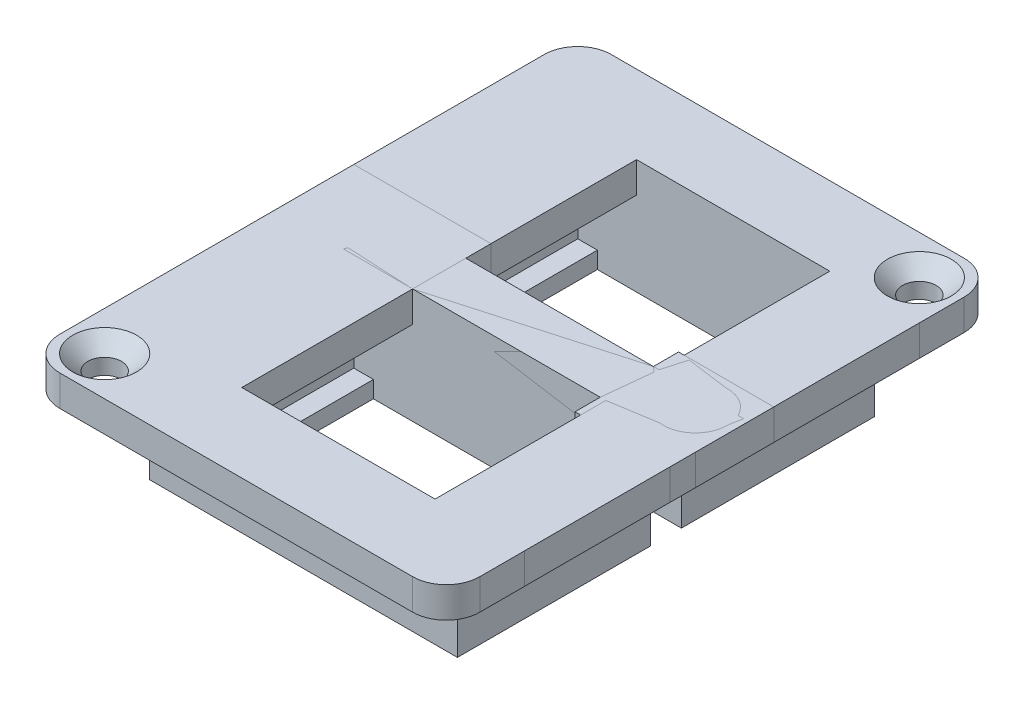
ISO-10303-21;
HEADER;
FILE_DESCRIPTION(('STEP AP214'),'2;1');
FILE_NAME('part.step','',(''),(''),'','','');
FILE_SCHEMA(('AUTOMOTIVE_DESIGN { 1 0 10303 214 1 1 1 1 }'));
ENDSEC;
DATA;
#1=APPLICATION_CONTEXT('core data for automotive mechanical design processes');
#2=APPLICATION_PROTOCOL_DEFINITION('international standard','automotive_design',2000,#1);
#3=PRODUCT_CONTEXT('',#1,'mechanical');
#4=PRODUCT('Part','Part','',(#3));
#5=PRODUCT_RELATED_PRODUCT_CATEGORY('part','',(#4));
#6=PRODUCT_DEFINITION_FORMATION('','',#4);
#7=PRODUCT_DEFINITION_CONTEXT('part definition',#1,'design');
#8=PRODUCT_DEFINITION('design','',#6,#7);
#9=PRODUCT_DEFINITION_SHAPE('','',#8);
#10=(LENGTH_UNIT() NAMED_UNIT(*) SI_UNIT(.MILLI.,.METRE.));
#11=(NAMED_UNIT(*) PLANE_ANGLE_UNIT() SI_UNIT($,.RADIAN.));
#12=(NAMED_UNIT(*) SI_UNIT($,.STERADIAN.) SOLID_ANGLE_UNIT());
#13=UNCERTAINTY_MEASURE_WITH_UNIT(LENGTH_MEASURE(1.E-05),#10,'distance_accuracy_value','');
#14=(GEOMETRIC_REPRESENTATION_CONTEXT(3) GLOBAL_UNCERTAINTY_ASSIGNED_CONTEXT((#13)) GLOBAL_UNIT_ASSIGNED_CONTEXT((#10,
#11,#12)) REPRESENTATION_CONTEXT('',''));
#15=CARTESIAN_POINT('',(0.,0.,0.));
#16=DIRECTION('',(0.,0.,1.));
#17=DIRECTION('',(1.,0.,0.));
#18=AXIS2_PLACEMENT_3D('',#15,#16,#17);
#19=CARTESIAN_POINT('',(0.,0.,2.25));
#20=DIRECTION('',(0.,0.,-1.));
#21=DIRECTION('',(-1.,0.,0.));
#22=AXIS2_PLACEMENT_3D('',#19,#20,#21);
#23=PLANE('',#22);
#24=DIRECTION('',(1.,0.,0.));
#25=VECTOR('',#24,1.);
#26=CARTESIAN_POINT('',(18.753383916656,-1.9966045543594,2.25));
#27=LINE('',#26,#25);
#28=CARTESIAN_POINT('',(-18.7533839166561,-1.9966045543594,2.25));
#29=VERTEX_POINT('',#28);
#30=CARTESIAN_POINT('',(-6.50338391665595,-1.9966045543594,2.25));
#31=VERTEX_POINT('',#30);
#32=EDGE_CURVE('E435',#29,#31,#27,.T.);
#33=ORIENTED_EDGE('',*,*,#32,.T.);
#34=DIRECTION('',(0.,1.,0.));
#35=VECTOR('',#34,1.);
#36=CARTESIAN_POINT('',(-6.50338391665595,0.,2.25));
#37=LINE('',#36,#35);
#38=CARTESIAN_POINT('',(-6.50338391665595,0.750000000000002,2.25));
#39=VERTEX_POINT('',#38);
#40=EDGE_CURVE('E51',#31,#39,#37,.T.);
#41=ORIENTED_EDGE('',*,*,#40,.T.);
#42=DIRECTION('',(-1.,0.,0.));
#43=VECTOR('',#42,1.);
#44=CARTESIAN_POINT('',(-18.7533839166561,0.750000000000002,2.25));
#45=LINE('',#44,#43);
#46=CARTESIAN_POINT('',(-18.7533839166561,0.750000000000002,2.25));
#47=VERTEX_POINT('',#46);
#48=EDGE_CURVE('E432',#39,#47,#45,.T.);
#49=ORIENTED_EDGE('',*,*,#48,.T.);
#50=DIRECTION('',(0.,-1.,0.));
#51=VECTOR('',#50,1.);
#52=CARTESIAN_POINT('',(-18.7533839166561,-1.9966045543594,2.25));
#53=LINE('',#52,#51);
#54=EDGE_CURVE('E431',#47,#29,#53,.T.);
#55=ORIENTED_EDGE('',*,*,#54,.T.);
#56=EDGE_LOOP('',(#33,#41,#49,#55));
#57=FACE_BOUND('',#56,.T.);
#58=ADVANCED_FACE('F43',(#57),#23,.F.);
#59=CARTESIAN_POINT('',(10.753383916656,-1.9966045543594,-4.75));
#60=DIRECTION('',(0.,1.,0.));
#61=DIRECTION('',(0.,0.,1.));
#62=AXIS2_PLACEMENT_3D('',#59,#60,#61);
#63=PLANE('',#62);
#64=DIRECTION('',(0.,0.,-1.));
#65=VECTOR('',#64,1.);
#66=CARTESIAN_POINT('',(-11.7499999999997,-1.99660455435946,-4.75));
#67=LINE('',#66,#65);
#68=CARTESIAN_POINT('',(-11.7499999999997,-1.9966045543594,-4.75));
#69=VERTEX_POINT('',#68);
#70=CARTESIAN_POINT('',(-11.7499999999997,-1.9966045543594,-20.));
#71=VERTEX_POINT('',#70);
#72=EDGE_CURVE('E406',#69,#71,#67,.T.);
#73=ORIENTED_EDGE('',*,*,#72,.T.);
#74=DIRECTION('',(1.,0.,0.));
#75=VECTOR('',#74,1.);
#76=CARTESIAN_POINT('',(-13.7500000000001,-1.9966045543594,-20.));
#77=LINE('',#76,#75);
#78=CARTESIAN_POINT('',(-6.50338391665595,-1.9966045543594,-20.));
#79=VERTEX_POINT('',#78);
#80=EDGE_CURVE('E307',#71,#79,#77,.T.);
#81=ORIENTED_EDGE('',*,*,#80,.T.);
#82=DIRECTION('',(0.,0.,-1.));
#83=VECTOR('',#82,1.);
#84=CARTESIAN_POINT('',(-6.50338391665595,-1.9966045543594,-4.75));
#85=LINE('',#84,#83);
#86=CARTESIAN_POINT('',(-6.50338391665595,-1.9966045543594,-4.75));
#87=VERTEX_POINT('',#86);
#88=EDGE_CURVE('E404',#87,#79,#85,.T.);
#89=ORIENTED_EDGE('',*,*,#88,.F.);
#90=DIRECTION('',(1.,0.,0.));
#91=VECTOR('',#90,1.);
#92=CARTESIAN_POINT('',(-13.7500000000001,-1.9966045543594,-4.75));
#93=LINE('',#92,#91);
#94=EDGE_CURVE('E316',#69,#87,#93,.T.);
#95=ORIENTED_EDGE('',*,*,#94,.F.);
#96=EDGE_LOOP('',(#73,#81,#89,#95));
#97=FACE_BOUND('',#96,.T.);
#98=ADVANCED_FACE('F609',(#97),#63,.F.);
#99=CARTESIAN_POINT('',(-15.2500000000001,-1.9966045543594,-1.25));
#100=DIRECTION('',(0.,-1.,0.));
#101=DIRECTION('',(0.,0.,-1.));
#102=AXIS2_PLACEMENT_3D('',#99,#100,#101);
#103=CIRCLE('',#102,1.5);
#104=CARTESIAN_POINT('',(-15.2500000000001,-1.9966045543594,-2.75));
#105=VERTEX_POINT('',#104);
#106=EDGE_CURVE('E338',#105,#105,#103,.T.);
#107=ORIENTED_EDGE('',*,*,#106,.F.);
#108=EDGE_LOOP('',(#107));
#109=FACE_BOUND('',#108,.T.);
#110=CARTESIAN_POINT('',(15.25,-1.9966045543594,-23.5));
#111=DIRECTION('',(0.,-1.,0.));
#112=DIRECTION('',(0.,0.,-1.));
#113=AXIS2_PLACEMENT_3D('',#110,#111,#112);
#114=CIRCLE('',#113,1.5);
#115=CARTESIAN_POINT('',(15.25,-1.9966045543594,-25.));
#116=VERTEX_POINT('',#115);
#117=EDGE_CURVE('E342',#116,#116,#114,.T.);
#118=ORIENTED_EDGE('',*,*,#117,.F.);
#119=EDGE_LOOP('',(#118));
#120=FACE_BOUND('',#119,.T.);
#121=DIRECTION('',(1.,0.,0.));
#122=VECTOR('',#121,1.);
#123=CARTESIAN_POINT('',(10.25,-1.9966045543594,0.));
#124=LINE('',#123,#122);
#125=CARTESIAN_POINT('',(-6.50338391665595,-1.9966045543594,0.));
#126=VERTEX_POINT('',#125);
#127=CARTESIAN_POINT('',(10.25,-1.9966045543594,0.));
#128=VERTEX_POINT('',#127);
#129=EDGE_CURVE('E269',#126,#128,#124,.T.);
#130=ORIENTED_EDGE('',*,*,#129,.F.);
#131=DIRECTION('',(0.,0.,-1.));
#132=VECTOR('',#131,1.);
#133=CARTESIAN_POINT('',(-6.50338391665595,-1.9966045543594,15.25));
#134=LINE('',#133,#132);
#135=EDGE_CURVE('E275',#31,#126,#134,.T.);
#136=ORIENTED_EDGE('',*,*,#135,.F.);
#137=ORIENTED_EDGE('',*,*,#32,.F.);
#138=DIRECTION('',(0.,0.,-1.));
#139=VECTOR('',#138,1.);
#140=CARTESIAN_POINT('',(-18.7533839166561,-1.9966045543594,2.25));
#141=LINE('',#140,#139);
#142=CARTESIAN_POINT('',(-18.7533839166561,-1.9966045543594,-4.75));
#143=VERTEX_POINT('',#142);
#144=EDGE_CURVE('E457',#29,#143,#141,.T.);
#145=ORIENTED_EDGE('',*,*,#144,.T.);
#146=DIRECTION('',(1.,0.,0.));
#147=VECTOR('',#146,1.);
#148=CARTESIAN_POINT('',(18.753383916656,-1.9966045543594,-4.75));
#149=LINE('',#148,#147);
#150=CARTESIAN_POINT('',(-18.7500000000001,-1.9966045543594,-4.75));
#151=VERTEX_POINT('',#150);
#152=EDGE_CURVE('E447',#143,#151,#149,.T.);
#153=ORIENTED_EDGE('',*,*,#152,.T.);
#154=DIRECTION('',(0.,0.,-1.));
#155=VECTOR('',#154,1.);
#156=CARTESIAN_POINT('',(-18.7500000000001,-1.9966045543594,-4.75));
#157=LINE('',#156,#155);
#158=CARTESIAN_POINT('',(-18.7500000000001,-1.9966045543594,-20.));
#159=VERTEX_POINT('',#158);
#160=EDGE_CURVE('E421',#151,#159,#157,.T.);
#161=ORIENTED_EDGE('',*,*,#160,.T.);
#162=DIRECTION('',(-1.,0.,0.));
#163=VECTOR('',#162,1.);
#164=CARTESIAN_POINT('',(-18.7533839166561,-1.9966045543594,-20.));
#165=LINE('',#164,#163);
#166=CARTESIAN_POINT('',(-18.7533839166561,-1.9966045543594,-20.));
#167=VERTEX_POINT('',#166);
#168=EDGE_CURVE('E361',#159,#167,#165,.T.);
#169=ORIENTED_EDGE('',*,*,#168,.T.);
#170=DIRECTION('',(0.,0.,1.));
#171=VECTOR('',#170,1.);
#172=CARTESIAN_POINT('',(-18.7533839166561,-1.9966045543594,-27.));
#173=LINE('',#172,#171);
#174=CARTESIAN_POINT('',(-18.7533839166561,-1.9966045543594,-24.));
#175=VERTEX_POINT('',#174);
#176=EDGE_CURVE('E368',#175,#167,#173,.T.);
#177=ORIENTED_EDGE('',*,*,#176,.F.);
#178=CARTESIAN_POINT('',(-15.7533839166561,-1.9966045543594,-24.));
#179=DIRECTION('',(0.,1.,0.));
#180=DIRECTION('',(0.,0.,1.));
#181=AXIS2_PLACEMENT_3D('',#178,#179,#180);
#182=CIRCLE('',#181,3.);
#183=CARTESIAN_POINT('',(-15.7533839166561,-1.9966045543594,-27.));
#184=VERTEX_POINT('',#183);
#185=EDGE_CURVE('E527',#175,#184,#182,.F.);
#186=ORIENTED_EDGE('',*,*,#185,.T.);
#187=DIRECTION('',(-1.,0.,0.));
#188=VECTOR('',#187,1.);
#189=CARTESIAN_POINT('',(-18.7533839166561,-1.9966045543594,-27.));
#190=LINE('',#189,#188);
#191=CARTESIAN_POINT('',(15.7533839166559,-1.9966045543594,-27.));
#192=VERTEX_POINT('',#191);
#193=EDGE_CURVE('E349',#192,#184,#190,.T.);
#194=ORIENTED_EDGE('',*,*,#193,.F.);
#195=CARTESIAN_POINT('',(15.753383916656,-1.9966045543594,-24.));
#196=DIRECTION('',(0.,1.,0.));
#197=DIRECTION('',(0.,0.,1.));
#198=AXIS2_PLACEMENT_3D('',#195,#196,#197);
#199=CIRCLE('',#198,3.);
#200=CARTESIAN_POINT('',(18.753383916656,-1.9966045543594,-24.));
#201=VERTEX_POINT('',#200);
#202=EDGE_CURVE('E529',#192,#201,#199,.F.);
#203=ORIENTED_EDGE('',*,*,#202,.T.);
#204=DIRECTION('',(0.,0.,1.));
#205=VECTOR('',#204,1.);
#206=CARTESIAN_POINT('',(18.753383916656,-1.9966045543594,-27.));
#207=LINE('',#206,#205);
#208=CARTESIAN_POINT('',(18.753383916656,-1.9966045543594,-20.));
#209=VERTEX_POINT('',#208);
#210=EDGE_CURVE('E370',#201,#209,#207,.T.);
#211=ORIENTED_EDGE('',*,*,#210,.T.);
#212=CARTESIAN_POINT('',(18.75,-1.9966045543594,-20.));
#213=VERTEX_POINT('',#212);
#214=EDGE_CURVE('E362',#209,#213,#165,.T.);
#215=ORIENTED_EDGE('',*,*,#214,.T.);
#216=DIRECTION('',(0.,0.,-1.));
#217=VECTOR('',#216,1.);
#218=CARTESIAN_POINT('',(18.75,-1.9966045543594,-4.75));
#219=LINE('',#218,#217);
#220=CARTESIAN_POINT('',(18.75,-1.9966045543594,-4.75));
#221=VERTEX_POINT('',#220);
#222=EDGE_CURVE('E505',#221,#213,#219,.T.);
#223=ORIENTED_EDGE('',*,*,#222,.F.);
#224=CARTESIAN_POINT('',(18.753383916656,-1.9966045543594,-4.75));
#225=VERTEX_POINT('',#224);
#226=EDGE_CURVE('E446',#221,#225,#149,.T.);
#227=ORIENTED_EDGE('',*,*,#226,.T.);
#228=DIRECTION('',(0.,0.,-1.));
#229=VECTOR('',#228,1.);
#230=CARTESIAN_POINT('',(18.753383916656,-1.9966045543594,2.25));
#231=LINE('',#230,#229);
#232=CARTESIAN_POINT('',(18.753383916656,-1.9966045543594,2.25));
#233=VERTEX_POINT('',#232);
#234=EDGE_CURVE('E454',#233,#225,#231,.T.);
#235=ORIENTED_EDGE('',*,*,#234,.F.);
#236=CARTESIAN_POINT('',(10.25,-1.9966045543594,2.25));
#237=VERTEX_POINT('',#236);
#238=EDGE_CURVE('E434',#237,#233,#27,.T.);
#239=ORIENTED_EDGE('',*,*,#238,.F.);
#240=DIRECTION('',(0.,0.,1.));
#241=VECTOR('',#240,1.);
#242=CARTESIAN_POINT('',(10.25,-1.9966045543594,15.25));
#243=LINE('',#242,#241);
#244=EDGE_CURVE('E58',#128,#237,#243,.T.);
#245=ORIENTED_EDGE('',*,*,#244,.F.);
#246=EDGE_LOOP('',(#130,#136,#137,#145,#153,#161,#169,#177,#186,#194,#203,#211,#215,#223,#227,
#235,#239,#245));
#247=FACE_BOUND('',#246,.T.);
#248=DIRECTION('',(1.,0.,0.));
#249=VECTOR('',#248,1.);
#250=CARTESIAN_POINT('',(-13.7500000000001,-1.9966045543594,-21.));
#251=LINE('',#250,#249);
#252=CARTESIAN_POINT('',(-13.7500000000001,-1.9966045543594,-21.));
#253=VERTEX_POINT('',#252);
#254=CARTESIAN_POINT('',(13.75,-1.9966045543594,-21.));
#255=VERTEX_POINT('',#254);
#256=EDGE_CURVE('E301',#253,#255,#251,.T.);
#257=ORIENTED_EDGE('',*,*,#256,.F.);
#258=DIRECTION('',(0.,0.,-1.));
#259=VECTOR('',#258,1.);
#260=CARTESIAN_POINT('',(-13.7500000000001,-1.9966045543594,-4.75));
#261=LINE('',#260,#259);
#262=CARTESIAN_POINT('',(-13.7500000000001,-1.9966045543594,-3.75));
#263=VERTEX_POINT('',#262);
#264=EDGE_CURVE('E419',#263,#253,#261,.T.);
#265=ORIENTED_EDGE('',*,*,#264,.F.);
#266=DIRECTION('',(1.,0.,0.));
#267=VECTOR('',#266,1.);
#268=CARTESIAN_POINT('',(-13.7500000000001,-1.9966045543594,-3.75));
#269=LINE('',#268,#267);
#270=CARTESIAN_POINT('',(13.75,-1.9966045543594,-3.75));
#271=VERTEX_POINT('',#270);
#272=EDGE_CURVE('E320',#263,#271,#269,.T.);
#273=ORIENTED_EDGE('',*,*,#272,.T.);
#274=DIRECTION('',(0.,0.,-1.));
#275=VECTOR('',#274,1.);
#276=CARTESIAN_POINT('',(13.75,-1.9966045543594,-4.75));
#277=LINE('',#276,#275);
#278=EDGE_CURVE('E508',#271,#255,#277,.T.);
#279=ORIENTED_EDGE('',*,*,#278,.T.);
#280=EDGE_LOOP('',(#257,#265,#273,#279));
#281=FACE_BOUND('',#280,.T.);
#282=ADVANCED_FACE('F282',(#109,#120,#247,#281),#63,.F.);
#283=DIRECTION('',(0.,0.,-1.));
#284=VECTOR('',#283,1.);
#285=CARTESIAN_POINT('',(10.753383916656,-1.9966045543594,-4.75));
#286=LINE('',#285,#284);
#287=CARTESIAN_POINT('',(10.753383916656,-1.9966045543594,-4.75));
#288=VERTEX_POINT('',#287);
#289=CARTESIAN_POINT('',(10.753383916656,-1.9966045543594,-20.));
#290=VERTEX_POINT('',#289);
#291=EDGE_CURVE('E496',#288,#290,#286,.T.);
#292=ORIENTED_EDGE('',*,*,#291,.T.);
#293=CARTESIAN_POINT('',(11.75,-1.9966045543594,-20.));
#294=VERTEX_POINT('',#293);
#295=EDGE_CURVE('E304',#290,#294,#77,.T.);
#296=ORIENTED_EDGE('',*,*,#295,.T.);
#297=DIRECTION('',(0.,0.,-1.));
#298=VECTOR('',#297,1.);
#299=CARTESIAN_POINT('',(11.75,-1.9966045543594,-4.75));
#300=LINE('',#299,#298);
#301=CARTESIAN_POINT('',(11.75,-1.9966045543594,-4.75));
#302=VERTEX_POINT('',#301);
#303=EDGE_CURVE('E493',#302,#294,#300,.T.);
#304=ORIENTED_EDGE('',*,*,#303,.F.);
#305=EDGE_CURVE('E323',#288,#302,#93,.T.);
#306=ORIENTED_EDGE('',*,*,#305,.F.);
#307=EDGE_LOOP('',(#292,#296,#304,#306));
#308=FACE_BOUND('',#307,.T.);
#309=ADVANCED_FACE('F616',(#308),#63,.F.);
#310=CARTESIAN_POINT('',(0.,0.,-4.75));
#311=DIRECTION('',(0.,0.,-1.));
#312=DIRECTION('',(-1.,0.,0.));
#313=AXIS2_PLACEMENT_3D('',#310,#311,#312);
#314=PLANE('',#313);
#315=DIRECTION('',(-1.,0.,0.));
#316=VECTOR('',#315,1.);
#317=CARTESIAN_POINT('',(-18.7533839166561,0.750000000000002,-4.75));
#318=LINE('',#317,#316);
#319=CARTESIAN_POINT('',(-18.7500000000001,0.75,-4.75));
#320=VERTEX_POINT('',#319);
#321=CARTESIAN_POINT('',(-18.7533839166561,0.750000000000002,-4.75));
#322=VERTEX_POINT('',#321);
#323=EDGE_CURVE('E427',#320,#322,#318,.T.);
#324=ORIENTED_EDGE('',*,*,#323,.F.);
#325=DIRECTION('',(0.,-1.,0.));
#326=VECTOR('',#325,1.);
#327=CARTESIAN_POINT('',(-18.7500000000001,0.75,-4.75));
#328=LINE('',#327,#326);
#329=EDGE_CURVE('E375',#320,#151,#328,.T.);
#330=ORIENTED_EDGE('',*,*,#329,.T.);
#331=ORIENTED_EDGE('',*,*,#152,.F.);
#332=DIRECTION('',(0.,-1.,0.));
#333=VECTOR('',#332,1.);
#334=CARTESIAN_POINT('',(-18.7533839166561,-1.9966045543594,-4.75));
#335=LINE('',#334,#333);
#336=EDGE_CURVE('E443',#322,#143,#335,.T.);
#337=ORIENTED_EDGE('',*,*,#336,.F.);
#338=EDGE_LOOP('',(#324,#330,#331,#337));
#339=FACE_BOUND('',#338,.T.);
#340=ADVANCED_FACE('F553',(#339),#314,.T.);
#341=DIRECTION('',(0.,1.,0.));
#342=VECTOR('',#341,1.);
#343=CARTESIAN_POINT('',(-6.50338391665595,0.75,-4.75));
#344=LINE('',#343,#342);
#345=CARTESIAN_POINT('',(-6.50338391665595,0.750000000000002,-4.75));
#346=VERTEX_POINT('',#345);
#347=EDGE_CURVE('E388',#87,#346,#344,.T.);
#348=ORIENTED_EDGE('',*,*,#347,.T.);
#349=CARTESIAN_POINT('',(10.753383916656,0.75,-4.75));
#350=VERTEX_POINT('',#349);
#351=EDGE_CURVE('E444',#350,#346,#318,.T.);
#352=ORIENTED_EDGE('',*,*,#351,.F.);
#353=DIRECTION('',(0.,-1.,0.));
#354=VECTOR('',#353,1.);
#355=CARTESIAN_POINT('',(10.753383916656,0.75,-4.75));
#356=LINE('',#355,#354);
#357=EDGE_CURVE('E474',#350,#288,#356,.T.);
#358=ORIENTED_EDGE('',*,*,#357,.T.);
#359=ORIENTED_EDGE('',*,*,#305,.T.);
#360=DIRECTION('',(0.,-1.,0.));
#361=VECTOR('',#360,1.);
#362=CARTESIAN_POINT('',(11.75,-8.,-4.75));
#363=LINE('',#362,#361);
#364=CARTESIAN_POINT('',(11.75,-8.,-4.75));
#365=VERTEX_POINT('',#364);
#366=EDGE_CURVE('E477',#302,#365,#363,.T.);
#367=ORIENTED_EDGE('',*,*,#366,.T.);
#368=DIRECTION('',(-1.,0.,0.));
#369=VECTOR('',#368,1.);
#370=CARTESIAN_POINT('',(10.25,-8.,-4.75));
#371=LINE('',#370,#369);
#372=CARTESIAN_POINT('',(10.25,-8.,-4.75));
#373=VERTEX_POINT('',#372);
#374=EDGE_CURVE('E464',#365,#373,#371,.T.);
#375=ORIENTED_EDGE('',*,*,#374,.T.);
#376=DIRECTION('',(0.,-1.,0.));
#377=VECTOR('',#376,1.);
#378=CARTESIAN_POINT('',(10.25,-8.,-4.75));
#379=LINE('',#378,#377);
#380=CARTESIAN_POINT('',(10.25,-9.5,-4.75));
#381=VERTEX_POINT('',#380);
#382=EDGE_CURVE('E467',#373,#381,#379,.T.);
#383=ORIENTED_EDGE('',*,*,#382,.T.);
#384=DIRECTION('',(1.,0.,0.));
#385=VECTOR('',#384,1.);
#386=CARTESIAN_POINT('',(-13.7500000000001,-9.50000000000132,-4.75));
#387=LINE('',#386,#385);
#388=CARTESIAN_POINT('',(-10.0000000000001,-9.50000000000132,-4.75));
#389=VERTEX_POINT('',#388);
#390=EDGE_CURVE('E315',#389,#381,#387,.T.);
#391=ORIENTED_EDGE('',*,*,#390,.F.);
#392=DIRECTION('',(0.,1.,0.));
#393=VECTOR('',#392,1.);
#394=CARTESIAN_POINT('',(-10.0000000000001,-9.50000000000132,-4.75));
#395=LINE('',#394,#393);
#396=CARTESIAN_POINT('',(-10.0000000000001,-8.00000000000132,-4.75));
#397=VERTEX_POINT('',#396);
#398=EDGE_CURVE('E378',#389,#397,#395,.T.);
#399=ORIENTED_EDGE('',*,*,#398,.T.);
#400=DIRECTION('',(-1.,0.,0.));
#401=VECTOR('',#400,1.);
#402=CARTESIAN_POINT('',(-11.7499999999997,-8.00000000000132,-4.75));
#403=LINE('',#402,#401);
#404=CARTESIAN_POINT('',(-11.7499999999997,-8.00000000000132,-4.75));
#405=VERTEX_POINT('',#404);
#406=EDGE_CURVE('E382',#397,#405,#403,.T.);
#407=ORIENTED_EDGE('',*,*,#406,.T.);
#408=DIRECTION('',(0.,1.,0.));
#409=VECTOR('',#408,1.);
#410=CARTESIAN_POINT('',(-11.7499999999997,-8.00000000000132,-4.75));
#411=LINE('',#410,#409);
#412=EDGE_CURVE('E385',#405,#69,#411,.T.);
#413=ORIENTED_EDGE('',*,*,#412,.T.);
#414=ORIENTED_EDGE('',*,*,#94,.T.);
#415=EDGE_LOOP('',(#348,#352,#358,#359,#367,#375,#383,#391,#399,#407,#413,#414));
#416=FACE_BOUND('',#415,.T.);
#417=ADVANCED_FACE('F659',(#416),#314,.T.);
#418=CARTESIAN_POINT('',(10.25,-8.,-4.75));
#419=DIRECTION('',(0.,-1.,0.));
#420=DIRECTION('',(1.,0.,0.));
#421=AXIS2_PLACEMENT_3D('',#418,#419,#420);
#422=PLANE('',#421);
#423=DIRECTION('',(-1.,0.,0.));
#424=VECTOR('',#423,1.);
#425=CARTESIAN_POINT('',(10.25,-8.,-20.));
#426=LINE('',#425,#424);
#427=CARTESIAN_POINT('',(11.75,-8.,-20.));
#428=VERTEX_POINT('',#427);
#429=CARTESIAN_POINT('',(10.25,-8.,-20.));
#430=VERTEX_POINT('',#429);
#431=EDGE_CURVE('E463',#428,#430,#426,.T.);
#432=ORIENTED_EDGE('',*,*,#431,.T.);
#433=DIRECTION('',(0.,0.,-1.));
#434=VECTOR('',#433,1.);
#435=CARTESIAN_POINT('',(10.25,-8.,-4.75));
#436=LINE('',#435,#434);
#437=EDGE_CURVE('E515',#373,#430,#436,.T.);
#438=ORIENTED_EDGE('',*,*,#437,.F.);
#439=ORIENTED_EDGE('',*,*,#374,.F.);
#440=DIRECTION('',(0.,0.,-1.));
#441=VECTOR('',#440,1.);
#442=CARTESIAN_POINT('',(11.75,-8.,-4.75));
#443=LINE('',#442,#441);
#444=EDGE_CURVE('E480',#365,#428,#443,.T.);
#445=ORIENTED_EDGE('',*,*,#444,.T.);
#446=EDGE_LOOP('',(#432,#438,#439,#445));
#447=FACE_BOUND('',#446,.T.);
#448=ADVANCED_FACE('F656',(#447),#422,.F.);
#449=CARTESIAN_POINT('',(10.25,-8.,-4.75));
#450=DIRECTION('',(1.,0.,0.));
#451=DIRECTION('',(0.,0.,-1.));
#452=AXIS2_PLACEMENT_3D('',#449,#450,#451);
#453=PLANE('',#452);
#454=DIRECTION('',(0.,-1.,0.));
#455=VECTOR('',#454,1.);
#456=CARTESIAN_POINT('',(10.25,-8.,-20.));
#457=LINE('',#456,#455);
#458=CARTESIAN_POINT('',(10.25,-9.5,-20.));
#459=VERTEX_POINT('',#458);
#460=EDGE_CURVE('E483',#430,#459,#457,.T.);
#461=ORIENTED_EDGE('',*,*,#460,.T.);
#462=DIRECTION('',(0.,0.,-1.));
#463=VECTOR('',#462,1.);
#464=CARTESIAN_POINT('',(10.25,-9.5,-4.75));
#465=LINE('',#464,#463);
#466=EDGE_CURVE('E512',#381,#459,#465,.T.);
#467=ORIENTED_EDGE('',*,*,#466,.F.);
#468=ORIENTED_EDGE('',*,*,#382,.F.);
#469=ORIENTED_EDGE('',*,*,#437,.T.);
#470=EDGE_LOOP('',(#461,#467,#468,#469));
#471=FACE_BOUND('',#470,.T.);
#472=ADVANCED_FACE('F652',(#471),#453,.F.);
#473=CARTESIAN_POINT('',(10.25,-9.5,-4.75));
#474=DIRECTION('',(0.,1.,0.));
#475=DIRECTION('',(0.,0.,1.));
#476=AXIS2_PLACEMENT_3D('',#473,#474,#475);
#477=PLANE('',#476);
#478=DIRECTION('',(1.,0.,0.));
#479=VECTOR('',#478,1.);
#480=CARTESIAN_POINT('',(-13.7500000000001,-9.50000000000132,-20.));
#481=LINE('',#480,#479);
#482=CARTESIAN_POINT('',(-10.0000000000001,-9.50000000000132,-20.));
#483=VERTEX_POINT('',#482);
#484=EDGE_CURVE('E305',#483,#459,#481,.T.);
#485=ORIENTED_EDGE('',*,*,#484,.F.);
#486=DIRECTION('',(0.,0.,-1.));
#487=VECTOR('',#486,1.);
#488=CARTESIAN_POINT('',(-10.0000000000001,-9.50000000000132,-4.75));
#489=LINE('',#488,#487);
#490=EDGE_CURVE('E415',#389,#483,#489,.T.);
#491=ORIENTED_EDGE('',*,*,#490,.F.);
#492=ORIENTED_EDGE('',*,*,#390,.T.);
#493=ORIENTED_EDGE('',*,*,#466,.T.);
#494=EDGE_LOOP('',(#485,#491,#492,#493));
#495=FACE_BOUND('',#494,.T.);
#496=DIRECTION('',(0.,0.,-1.));
#497=VECTOR('',#496,1.);
#498=CARTESIAN_POINT('',(-13.7500000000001,-9.50000000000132,-4.75));
#499=LINE('',#498,#497);
#500=CARTESIAN_POINT('',(-13.7500000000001,-9.50000000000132,-3.75));
#501=VERTEX_POINT('',#500);
#502=CARTESIAN_POINT('',(-13.7500000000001,-9.50000000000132,-21.));
#503=VERTEX_POINT('',#502);
#504=EDGE_CURVE('E417',#501,#503,#499,.T.);
#505=ORIENTED_EDGE('',*,*,#504,.T.);
#506=DIRECTION('',(1.,0.,0.));
#507=VECTOR('',#506,1.);
#508=CARTESIAN_POINT('',(-13.7500000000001,-9.50000000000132,-21.));
#509=LINE('',#508,#507);
#510=CARTESIAN_POINT('',(13.75,-9.50000000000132,-21.));
#511=VERTEX_POINT('',#510);
#512=EDGE_CURVE('E298',#503,#511,#509,.T.);
#513=ORIENTED_EDGE('',*,*,#512,.T.);
#514=DIRECTION('',(0.,0.,-1.));
#515=VECTOR('',#514,1.);
#516=CARTESIAN_POINT('',(13.75,-9.5,-4.75));
#517=LINE('',#516,#515);
#518=CARTESIAN_POINT('',(13.75,-9.50000000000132,-3.75));
#519=VERTEX_POINT('',#518);
#520=EDGE_CURVE('E510',#519,#511,#517,.T.);
#521=ORIENTED_EDGE('',*,*,#520,.F.);
#522=DIRECTION('',(1.,0.,0.));
#523=VECTOR('',#522,1.);
#524=CARTESIAN_POINT('',(-13.7500000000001,-9.50000000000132,-3.75));
#525=LINE('',#524,#523);
#526=EDGE_CURVE('E312',#501,#519,#525,.T.);
#527=ORIENTED_EDGE('',*,*,#526,.F.);
#528=EDGE_LOOP('',(#505,#513,#521,#527));
#529=FACE_BOUND('',#528,.T.);
#530=ADVANCED_FACE('F648',(#495,#529),#477,.F.);
#531=CARTESIAN_POINT('',(13.75,-1.9966045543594,-4.75));
#532=DIRECTION('',(-1.,0.,0.));
#533=DIRECTION('',(0.,0.,1.));
#534=AXIS2_PLACEMENT_3D('',#531,#532,#533);
#535=PLANE('',#534);
#536=ORIENTED_EDGE('',*,*,#520,.T.);
#537=DIRECTION('',(0.,1.,0.));
#538=VECTOR('',#537,1.);
#539=CARTESIAN_POINT('',(13.75,-9.50000000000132,-21.));
#540=LINE('',#539,#538);
#541=EDGE_CURVE('E295',#511,#255,#540,.T.);
#542=ORIENTED_EDGE('',*,*,#541,.T.);
#543=ORIENTED_EDGE('',*,*,#278,.F.);
#544=DIRECTION('',(0.,1.,0.));
#545=VECTOR('',#544,1.);
#546=CARTESIAN_POINT('',(13.75,-9.50000000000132,-3.75));
#547=LINE('',#546,#545);
#548=EDGE_CURVE('E326',#519,#271,#547,.T.);
#549=ORIENTED_EDGE('',*,*,#548,.F.);
#550=EDGE_LOOP('',(#536,#542,#543,#549));
#551=FACE_BOUND('',#550,.T.);
#552=ADVANCED_FACE('F645',(#551),#535,.F.);
#553=CARTESIAN_POINT('',(18.75,0.75,-4.75));
#554=DIRECTION('',(-1.,0.,0.));
#555=DIRECTION('',(0.,0.,1.));
#556=AXIS2_PLACEMENT_3D('',#553,#554,#555);
#557=PLANE('',#556);
#558=DIRECTION('',(0.,1.,0.));
#559=VECTOR('',#558,1.);
#560=CARTESIAN_POINT('',(18.75,0.75,-20.));
#561=LINE('',#560,#559);
#562=CARTESIAN_POINT('',(18.75,0.75,-20.));
#563=VERTEX_POINT('',#562);
#564=EDGE_CURVE('E485',#213,#563,#561,.T.);
#565=ORIENTED_EDGE('',*,*,#564,.T.);
#566=DIRECTION('',(0.,0.,-1.));
#567=VECTOR('',#566,1.);
#568=CARTESIAN_POINT('',(18.75,0.75,-4.75));
#569=LINE('',#568,#567);
#570=CARTESIAN_POINT('',(18.75,0.75,-4.75));
#571=VERTEX_POINT('',#570);
#572=EDGE_CURVE('E502',#571,#563,#569,.T.);
#573=ORIENTED_EDGE('',*,*,#572,.F.);
#574=DIRECTION('',(0.,1.,0.));
#575=VECTOR('',#574,1.);
#576=CARTESIAN_POINT('',(18.75,0.75,-4.75));
#577=LINE('',#576,#575);
#578=EDGE_CURVE('E471',#221,#571,#577,.T.);
#579=ORIENTED_EDGE('',*,*,#578,.F.);
#580=ORIENTED_EDGE('',*,*,#222,.T.);
#581=EDGE_LOOP('',(#565,#573,#579,#580));
#582=FACE_BOUND('',#581,.T.);
#583=ADVANCED_FACE('F587',(#582),#557,.F.);
#584=CARTESIAN_POINT('',(10.753383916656,0.75,-4.75));
#585=DIRECTION('',(0.,-1.,0.));
#586=DIRECTION('',(0.,0.,-1.));
#587=AXIS2_PLACEMENT_3D('',#584,#585,#586);
#588=PLANE('',#587);
#589=ORIENTED_EDGE('',*,*,#48,.F.);
#590=DIRECTION('',(0.,0.,-1.));
#591=VECTOR('',#590,1.);
#592=CARTESIAN_POINT('',(-6.50338391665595,0.75,-4.75));
#593=LINE('',#592,#591);
#594=CARTESIAN_POINT('',(-6.50338391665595,0.75,0.));
#595=VERTEX_POINT('',#594);
#596=EDGE_CURVE('E292',#39,#595,#593,.T.);
#597=ORIENTED_EDGE('',*,*,#596,.T.);
#598=DIRECTION('',(1.,0.,0.));
#599=VECTOR('',#598,1.);
#600=CARTESIAN_POINT('',(10.753383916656,0.75,0.));
#601=LINE('',#600,#599);
#602=CARTESIAN_POINT('',(10.25,0.75,0.));
#603=VERTEX_POINT('',#602);
#604=EDGE_CURVE('E12',#595,#603,#601,.T.);
#605=ORIENTED_EDGE('',*,*,#604,.T.);
#606=DIRECTION('',(0.,0.,1.));
#607=VECTOR('',#606,1.);
#608=CARTESIAN_POINT('',(10.25,0.75,-4.75));
#609=LINE('',#608,#607);
#610=CARTESIAN_POINT('',(10.25,0.750000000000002,2.25));
#611=VERTEX_POINT('',#610);
#612=EDGE_CURVE('E288',#603,#611,#609,.T.);
#613=ORIENTED_EDGE('',*,*,#612,.T.);
#614=CARTESIAN_POINT('',(18.753383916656,0.750000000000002,2.25));
#615=VERTEX_POINT('',#614);
#616=EDGE_CURVE('E428',#615,#611,#45,.T.);
#617=ORIENTED_EDGE('',*,*,#616,.F.);
#618=DIRECTION('',(0.,0.,-1.));
#619=VECTOR('',#618,1.);
#620=CARTESIAN_POINT('',(18.753383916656,0.750000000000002,2.25));
#621=LINE('',#620,#619);
#622=CARTESIAN_POINT('',(18.753383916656,0.750000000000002,-4.75));
#623=VERTEX_POINT('',#622);
#624=EDGE_CURVE('E439',#615,#623,#621,.T.);
#625=ORIENTED_EDGE('',*,*,#624,.T.);
#626=EDGE_CURVE('E440',#623,#571,#318,.T.);
#627=ORIENTED_EDGE('',*,*,#626,.T.);
#628=ORIENTED_EDGE('',*,*,#572,.T.);
#629=DIRECTION('',(1.,0.,0.));
#630=VECTOR('',#629,1.);
#631=CARTESIAN_POINT('',(18.753383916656,0.75,-20.));
#632=LINE('',#631,#630);
#633=CARTESIAN_POINT('',(18.753383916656,0.75,-20.));
#634=VERTEX_POINT('',#633);
#635=EDGE_CURVE('E341',#563,#634,#632,.T.);
#636=ORIENTED_EDGE('',*,*,#635,.T.);
#637=DIRECTION('',(0.,0.,1.));
#638=VECTOR('',#637,1.);
#639=CARTESIAN_POINT('',(18.753383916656,0.75,-27.));
#640=LINE('',#639,#638);
#641=CARTESIAN_POINT('',(18.753383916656,0.75,-24.));
#642=VERTEX_POINT('',#641);
#643=EDGE_CURVE('E372',#642,#634,#640,.T.);
#644=ORIENTED_EDGE('',*,*,#643,.F.);
#645=CARTESIAN_POINT('',(15.753383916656,0.75,-24.));
#646=DIRECTION('',(0.,-1.,0.));
#647=DIRECTION('',(0.,0.,-1.));
#648=AXIS2_PLACEMENT_3D('',#645,#646,#647);
#649=CIRCLE('',#648,3.);
#650=CARTESIAN_POINT('',(15.753383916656,0.75,-27.));
#651=VERTEX_POINT('',#650);
#652=EDGE_CURVE('E534',#642,#651,#649,.F.);
#653=ORIENTED_EDGE('',*,*,#652,.T.);
#654=DIRECTION('',(1.,0.,0.));
#655=VECTOR('',#654,1.);
#656=CARTESIAN_POINT('',(18.753383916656,0.75,-27.));
#657=LINE('',#656,#655);
#658=CARTESIAN_POINT('',(-15.7533839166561,0.75,-27.));
#659=VERTEX_POINT('',#658);
#660=EDGE_CURVE('E346',#659,#651,#657,.T.);
#661=ORIENTED_EDGE('',*,*,#660,.F.);
#662=CARTESIAN_POINT('',(-15.7533839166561,0.75,-24.));
#663=DIRECTION('',(0.,-1.,0.));
#664=DIRECTION('',(0.,0.,-1.));
#665=AXIS2_PLACEMENT_3D('',#662,#663,#664);
#666=CIRCLE('',#665,3.);
#667=CARTESIAN_POINT('',(-18.7533839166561,0.75,-24.));
#668=VERTEX_POINT('',#667);
#669=EDGE_CURVE('E66',#659,#668,#666,.F.);
#670=ORIENTED_EDGE('',*,*,#669,.T.);
#671=DIRECTION('',(0.,0.,1.));
#672=VECTOR('',#671,1.);
#673=CARTESIAN_POINT('',(-18.7533839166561,0.75,-27.));
#674=LINE('',#673,#672);
#675=CARTESIAN_POINT('',(-18.7533839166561,0.75,-20.));
#676=VERTEX_POINT('',#675);
#677=EDGE_CURVE('E353',#668,#676,#674,.T.);
#678=ORIENTED_EDGE('',*,*,#677,.T.);
#679=CARTESIAN_POINT('',(-18.7500000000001,0.75,-20.));
#680=VERTEX_POINT('',#679);
#681=EDGE_CURVE('E354',#676,#680,#632,.T.);
#682=ORIENTED_EDGE('',*,*,#681,.T.);
#683=DIRECTION('',(0.,0.,-1.));
#684=VECTOR('',#683,1.);
#685=CARTESIAN_POINT('',(-18.7500000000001,0.75,-4.75));
#686=LINE('',#685,#684);
#687=EDGE_CURVE('E424',#320,#680,#686,.T.);
#688=ORIENTED_EDGE('',*,*,#687,.F.);
#689=ORIENTED_EDGE('',*,*,#323,.T.);
#690=DIRECTION('',(0.,0.,-1.));
#691=VECTOR('',#690,1.);
#692=CARTESIAN_POINT('',(-18.7533839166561,0.750000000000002,2.25));
#693=LINE('',#692,#691);
#694=EDGE_CURVE('E460',#47,#322,#693,.T.);
#695=ORIENTED_EDGE('',*,*,#694,.F.);
#696=EDGE_LOOP('',(#589,#597,#605,#613,#617,#625,#627,#628,#636,#644,#653,#661,#670,#678,#682,
#688,#689,#695));
#697=FACE_BOUND('',#696,.T.);
#698=CARTESIAN_POINT('',(-15.2500000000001,0.75,-1.25));
#699=DIRECTION('',(0.,1.,0.));
#700=DIRECTION('',(0.,0.,1.));
#701=AXIS2_PLACEMENT_3D('',#698,#699,#700);
#702=CIRCLE('',#701,2.85);
#703=CARTESIAN_POINT('',(-15.2500000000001,0.75,1.6));
#704=VERTEX_POINT('',#703);
#705=EDGE_CURVE('E332',#704,#704,#702,.T.);
#706=ORIENTED_EDGE('',*,*,#705,.F.);
#707=EDGE_LOOP('',(#706));
#708=FACE_BOUND('',#707,.T.);
#709=CARTESIAN_POINT('',(15.25,0.75,-23.5));
#710=DIRECTION('',(0.,1.,0.));
#711=DIRECTION('',(0.,0.,1.));
#712=AXIS2_PLACEMENT_3D('',#709,#710,#711);
#713=CIRCLE('',#712,2.85);
#714=CARTESIAN_POINT('',(15.25,0.75,-20.65));
#715=VERTEX_POINT('',#714);
#716=EDGE_CURVE('E329',#715,#715,#713,.T.);
#717=ORIENTED_EDGE('',*,*,#716,.F.);
#718=EDGE_LOOP('',(#717));
#719=FACE_BOUND('',#718,.T.);
#720=CARTESIAN_POINT('',(-6.50338391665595,0.75,-20.));
#721=VERTEX_POINT('',#720);
#722=CARTESIAN_POINT('',(10.753383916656,0.75,-20.));
#723=VERTEX_POINT('',#722);
#724=EDGE_CURVE('E358',#721,#723,#632,.T.);
#725=ORIENTED_EDGE('',*,*,#724,.T.);
#726=DIRECTION('',(0.,0.,-1.));
#727=VECTOR('',#726,1.);
#728=CARTESIAN_POINT('',(10.753383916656,0.75,-4.75));
#729=LINE('',#728,#727);
#730=EDGE_CURVE('E499',#350,#723,#729,.T.);
#731=ORIENTED_EDGE('',*,*,#730,.F.);
#732=ORIENTED_EDGE('',*,*,#351,.T.);
#733=DIRECTION('',(0.,0.,-1.));
#734=VECTOR('',#733,1.);
#735=CARTESIAN_POINT('',(-6.50338391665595,0.75,-4.75));
#736=LINE('',#735,#734);
#737=EDGE_CURVE('E391',#346,#721,#736,.T.);
#738=ORIENTED_EDGE('',*,*,#737,.T.);
#739=EDGE_LOOP('',(#725,#731,#732,#738));
#740=FACE_BOUND('',#739,.T.);
#741=ADVANCED_FACE('F543',(#697,#708,#719,#740),#588,.F.);
#742=CARTESIAN_POINT('',(10.753383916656,0.75,-4.75));
#743=DIRECTION('',(1.,0.,0.));
#744=DIRECTION('',(0.,0.,-1.));
#745=AXIS2_PLACEMENT_3D('',#742,#743,#744);
#746=PLANE('',#745);
#747=DIRECTION('',(0.,-1.,0.));
#748=VECTOR('',#747,1.);
#749=CARTESIAN_POINT('',(10.753383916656,0.75,-20.));
#750=LINE('',#749,#748);
#751=EDGE_CURVE('E488',#723,#290,#750,.T.);
#752=ORIENTED_EDGE('',*,*,#751,.T.);
#753=ORIENTED_EDGE('',*,*,#291,.F.);
#754=ORIENTED_EDGE('',*,*,#357,.F.);
#755=ORIENTED_EDGE('',*,*,#730,.T.);
#756=EDGE_LOOP('',(#752,#753,#754,#755));
#757=FACE_BOUND('',#756,.T.);
#758=ADVANCED_FACE('F633',(#757),#746,.F.);
#759=CARTESIAN_POINT('',(11.75,-8.,-4.75));
#760=DIRECTION('',(1.,0.,0.));
#761=DIRECTION('',(0.,0.,-1.));
#762=AXIS2_PLACEMENT_3D('',#759,#760,#761);
#763=PLANE('',#762);
#764=DIRECTION('',(0.,-1.,0.));
#765=VECTOR('',#764,1.);
#766=CARTESIAN_POINT('',(11.75,-8.,-20.));
#767=LINE('',#766,#765);
#768=EDGE_CURVE('E468',#294,#428,#767,.T.);
#769=ORIENTED_EDGE('',*,*,#768,.T.);
#770=ORIENTED_EDGE('',*,*,#444,.F.);
#771=ORIENTED_EDGE('',*,*,#366,.F.);
#772=ORIENTED_EDGE('',*,*,#303,.T.);
#773=EDGE_LOOP('',(#769,#770,#771,#772));
#774=FACE_BOUND('',#773,.T.);
#775=ADVANCED_FACE('F631',(#774),#763,.F.);
#776=ORIENTED_EDGE('',*,*,#226,.F.);
#777=ORIENTED_EDGE('',*,*,#578,.T.);
#778=ORIENTED_EDGE('',*,*,#626,.F.);
#779=DIRECTION('',(0.,1.,0.));
#780=VECTOR('',#779,1.);
#781=CARTESIAN_POINT('',(18.753383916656,0.750000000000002,-4.75));
#782=LINE('',#781,#780);
#783=EDGE_CURVE('E450',#225,#623,#782,.T.);
#784=ORIENTED_EDGE('',*,*,#783,.F.);
#785=EDGE_LOOP('',(#776,#777,#778,#784));
#786=FACE_BOUND('',#785,.T.);
#787=ADVANCED_FACE('F590',(#786),#314,.T.);
#788=CARTESIAN_POINT('',(-18.7533839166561,-1.9966045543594,2.25));
#789=DIRECTION('',(1.,0.,0.));
#790=DIRECTION('',(0.,0.,-1.));
#791=AXIS2_PLACEMENT_3D('',#788,#789,#790);
#792=PLANE('',#791);
#793=ORIENTED_EDGE('',*,*,#336,.T.);
#794=ORIENTED_EDGE('',*,*,#144,.F.);
#795=ORIENTED_EDGE('',*,*,#54,.F.);
#796=ORIENTED_EDGE('',*,*,#694,.T.);
#797=EDGE_LOOP('',(#793,#794,#795,#796));
#798=FACE_BOUND('',#797,.T.);
#799=ADVANCED_FACE('F549',(#798),#792,.F.);
#800=CARTESIAN_POINT('',(18.753383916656,0.750000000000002,2.25));
#801=DIRECTION('',(-1.,0.,0.));
#802=DIRECTION('',(0.,0.,1.));
#803=AXIS2_PLACEMENT_3D('',#800,#801,#802);
#804=PLANE('',#803);
#805=ORIENTED_EDGE('',*,*,#783,.T.);
#806=ORIENTED_EDGE('',*,*,#624,.F.);
#807=DIRECTION('',(0.,1.,0.));
#808=VECTOR('',#807,1.);
#809=CARTESIAN_POINT('',(18.753383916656,0.750000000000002,2.25));
#810=LINE('',#809,#808);
#811=EDGE_CURVE('E437',#233,#615,#810,.T.);
#812=ORIENTED_EDGE('',*,*,#811,.F.);
#813=ORIENTED_EDGE('',*,*,#234,.T.);
#814=EDGE_LOOP('',(#805,#806,#812,#813));
#815=FACE_BOUND('',#814,.T.);
#816=ADVANCED_FACE('F596',(#815),#804,.F.);
#817=ORIENTED_EDGE('',*,*,#616,.T.);
#818=DIRECTION('',(0.,-1.,0.));
#819=VECTOR('',#818,1.);
#820=CARTESIAN_POINT('',(10.25,0.,2.25));
#821=LINE('',#820,#819);
#822=EDGE_CURVE('E538',#611,#237,#821,.T.);
#823=ORIENTED_EDGE('',*,*,#822,.T.);
#824=ORIENTED_EDGE('',*,*,#238,.T.);
#825=ORIENTED_EDGE('',*,*,#811,.T.);
#826=EDGE_LOOP('',(#817,#823,#824,#825));
#827=FACE_BOUND('',#826,.T.);
#828=ADVANCED_FACE('F599',(#827),#23,.F.);
#829=CARTESIAN_POINT('',(-18.7500000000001,0.75,-4.75));
#830=DIRECTION('',(1.,0.,0.));
#831=DIRECTION('',(0.,0.,-1.));
#832=AXIS2_PLACEMENT_3D('',#829,#830,#831);
#833=PLANE('',#832);
#834=DIRECTION('',(0.,-1.,0.));
#835=VECTOR('',#834,1.);
#836=CARTESIAN_POINT('',(-18.7500000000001,0.75,-20.));
#837=LINE('',#836,#835);
#838=EDGE_CURVE('E374',#680,#159,#837,.T.);
#839=ORIENTED_EDGE('',*,*,#838,.T.);
#840=ORIENTED_EDGE('',*,*,#160,.F.);
#841=ORIENTED_EDGE('',*,*,#329,.F.);
#842=ORIENTED_EDGE('',*,*,#687,.T.);
#843=EDGE_LOOP('',(#839,#840,#841,#842));
#844=FACE_BOUND('',#843,.T.);
#845=ADVANCED_FACE('F555',(#844),#833,.F.);
#846=CARTESIAN_POINT('',(-13.7500000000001,-1.9966045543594,-4.75));
#847=DIRECTION('',(1.,0.,0.));
#848=DIRECTION('',(0.,0.,-1.));
#849=AXIS2_PLACEMENT_3D('',#846,#847,#848);
#850=PLANE('',#849);
#851=ORIENTED_EDGE('',*,*,#264,.T.);
#852=DIRECTION('',(0.,1.,0.));
#853=VECTOR('',#852,1.);
#854=CARTESIAN_POINT('',(-13.7500000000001,-9.50000000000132,-21.));
#855=LINE('',#854,#853);
#856=EDGE_CURVE('E294',#503,#253,#855,.T.);
#857=ORIENTED_EDGE('',*,*,#856,.F.);
#858=ORIENTED_EDGE('',*,*,#504,.F.);
#859=DIRECTION('',(0.,1.,0.));
#860=VECTOR('',#859,1.);
#861=CARTESIAN_POINT('',(-13.7500000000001,-9.50000000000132,-3.75));
#862=LINE('',#861,#860);
#863=EDGE_CURVE('E319',#501,#263,#862,.T.);
#864=ORIENTED_EDGE('',*,*,#863,.T.);
#865=EDGE_LOOP('',(#851,#857,#858,#864));
#866=FACE_BOUND('',#865,.T.);
#867=ADVANCED_FACE('F624',(#866),#850,.F.);
#868=CARTESIAN_POINT('',(-10.0000000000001,-9.50000000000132,-4.75));
#869=DIRECTION('',(-1.,0.,0.));
#870=DIRECTION('',(0.,0.,1.));
#871=AXIS2_PLACEMENT_3D('',#868,#869,#870);
#872=PLANE('',#871);
#873=DIRECTION('',(0.,1.,0.));
#874=VECTOR('',#873,1.);
#875=CARTESIAN_POINT('',(-10.0000000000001,-9.50000000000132,-20.));
#876=LINE('',#875,#874);
#877=CARTESIAN_POINT('',(-10.0000000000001,-8.00000000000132,-20.));
#878=VERTEX_POINT('',#877);
#879=EDGE_CURVE('E394',#483,#878,#876,.T.);
#880=ORIENTED_EDGE('',*,*,#879,.T.);
#881=DIRECTION('',(0.,0.,-1.));
#882=VECTOR('',#881,1.);
#883=CARTESIAN_POINT('',(-10.0000000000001,-8.00000000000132,-4.75));
#884=LINE('',#883,#882);
#885=EDGE_CURVE('E412',#397,#878,#884,.T.);
#886=ORIENTED_EDGE('',*,*,#885,.F.);
#887=ORIENTED_EDGE('',*,*,#398,.F.);
#888=ORIENTED_EDGE('',*,*,#490,.T.);
#889=EDGE_LOOP('',(#880,#886,#887,#888));
#890=FACE_BOUND('',#889,.T.);
#891=ADVANCED_FACE('F713',(#890),#872,.F.);
#892=CARTESIAN_POINT('',(-11.7499999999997,-8.00000000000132,-4.75));
#893=DIRECTION('',(0.,-1.,0.));
#894=DIRECTION('',(0.,0.,-1.));
#895=AXIS2_PLACEMENT_3D('',#892,#893,#894);
#896=PLANE('',#895);
#897=DIRECTION('',(-1.,0.,0.));
#898=VECTOR('',#897,1.);
#899=CARTESIAN_POINT('',(-11.7499999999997,-8.00000000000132,-20.));
#900=LINE('',#899,#898);
#901=CARTESIAN_POINT('',(-11.7499999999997,-8.00000000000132,-20.));
#902=VERTEX_POINT('',#901);
#903=EDGE_CURVE('E396',#878,#902,#900,.T.);
#904=ORIENTED_EDGE('',*,*,#903,.T.);
#905=DIRECTION('',(0.,0.,-1.));
#906=VECTOR('',#905,1.);
#907=CARTESIAN_POINT('',(-11.7499999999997,-8.00000000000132,-4.75));
#908=LINE('',#907,#906);
#909=EDGE_CURVE('E409',#405,#902,#908,.T.);
#910=ORIENTED_EDGE('',*,*,#909,.F.);
#911=ORIENTED_EDGE('',*,*,#406,.F.);
#912=ORIENTED_EDGE('',*,*,#885,.T.);
#913=EDGE_LOOP('',(#904,#910,#911,#912));
#914=FACE_BOUND('',#913,.T.);
#915=ADVANCED_FACE('F709',(#914),#896,.F.);
#916=CARTESIAN_POINT('',(-11.7499999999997,-8.00000000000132,-4.75));
#917=DIRECTION('',(-1.,0.,0.));
#918=DIRECTION('',(0.,-1.,0.));
#919=AXIS2_PLACEMENT_3D('',#916,#917,#918);
#920=PLANE('',#919);
#921=DIRECTION('',(0.,1.,0.));
#922=VECTOR('',#921,1.);
#923=CARTESIAN_POINT('',(-11.7499999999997,-8.00000000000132,-20.));
#924=LINE('',#923,#922);
#925=EDGE_CURVE('E398',#902,#71,#924,.T.);
#926=ORIENTED_EDGE('',*,*,#925,.T.);
#927=ORIENTED_EDGE('',*,*,#72,.F.);
#928=ORIENTED_EDGE('',*,*,#412,.F.);
#929=ORIENTED_EDGE('',*,*,#909,.T.);
#930=EDGE_LOOP('',(#926,#927,#928,#929));
#931=FACE_BOUND('',#930,.T.);
#932=ADVANCED_FACE('F705',(#931),#920,.F.);
#933=CARTESIAN_POINT('',(-6.50338391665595,0.75,-4.75));
#934=DIRECTION('',(-1.,0.,0.));
#935=DIRECTION('',(0.,0.,1.));
#936=AXIS2_PLACEMENT_3D('',#933,#934,#935);
#937=PLANE('',#936);
#938=DIRECTION('',(0.,1.,0.));
#939=VECTOR('',#938,1.);
#940=CARTESIAN_POINT('',(-6.50338391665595,0.75,-20.));
#941=LINE('',#940,#939);
#942=EDGE_CURVE('E379',#79,#721,#941,.T.);
#943=ORIENTED_EDGE('',*,*,#942,.T.);
#944=ORIENTED_EDGE('',*,*,#737,.F.);
#945=ORIENTED_EDGE('',*,*,#347,.F.);
#946=ORIENTED_EDGE('',*,*,#88,.T.);
#947=EDGE_LOOP('',(#943,#944,#945,#946));
#948=FACE_BOUND('',#947,.T.);
#949=ADVANCED_FACE('F698',(#948),#937,.F.);
#950=CARTESIAN_POINT('',(0.,0.,-20.));
#951=DIRECTION('',(0.,0.,1.));
#952=DIRECTION('',(1.,0.,0.));
#953=AXIS2_PLACEMENT_3D('',#950,#951,#952);
#954=PLANE('',#953);
#955=ORIENTED_EDGE('',*,*,#564,.F.);
#956=ORIENTED_EDGE('',*,*,#214,.F.);
#957=DIRECTION('',(0.,-1.,0.));
#958=VECTOR('',#957,1.);
#959=CARTESIAN_POINT('',(18.753383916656,-1.9966045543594,-20.));
#960=LINE('',#959,#958);
#961=EDGE_CURVE('E357',#634,#209,#960,.T.);
#962=ORIENTED_EDGE('',*,*,#961,.F.);
#963=ORIENTED_EDGE('',*,*,#635,.F.);
#964=EDGE_LOOP('',(#955,#956,#962,#963));
#965=FACE_BOUND('',#964,.T.);
#966=ADVANCED_FACE('F583',(#965),#954,.T.);
#967=ORIENTED_EDGE('',*,*,#751,.F.);
#968=ORIENTED_EDGE('',*,*,#724,.F.);
#969=ORIENTED_EDGE('',*,*,#942,.F.);
#970=ORIENTED_EDGE('',*,*,#80,.F.);
#971=ORIENTED_EDGE('',*,*,#925,.F.);
#972=ORIENTED_EDGE('',*,*,#903,.F.);
#973=ORIENTED_EDGE('',*,*,#879,.F.);
#974=ORIENTED_EDGE('',*,*,#484,.T.);
#975=ORIENTED_EDGE('',*,*,#460,.F.);
#976=ORIENTED_EDGE('',*,*,#431,.F.);
#977=ORIENTED_EDGE('',*,*,#768,.F.);
#978=ORIENTED_EDGE('',*,*,#295,.F.);
#979=EDGE_LOOP('',(#967,#968,#969,#970,#971,#972,#973,#974,#975,#976,#977,#978));
#980=FACE_BOUND('',#979,.T.);
#981=ADVANCED_FACE('F697',(#980),#954,.T.);
#982=ORIENTED_EDGE('',*,*,#838,.F.);
#983=ORIENTED_EDGE('',*,*,#681,.F.);
#984=DIRECTION('',(0.,1.,0.));
#985=VECTOR('',#984,1.);
#986=CARTESIAN_POINT('',(-18.7533839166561,0.75,-20.));
#987=LINE('',#986,#985);
#988=EDGE_CURVE('E350',#167,#676,#987,.T.);
#989=ORIENTED_EDGE('',*,*,#988,.F.);
#990=ORIENTED_EDGE('',*,*,#168,.F.);
#991=EDGE_LOOP('',(#982,#983,#989,#990));
#992=FACE_BOUND('',#991,.T.);
#993=ADVANCED_FACE('F559',(#992),#954,.T.);
#994=CARTESIAN_POINT('',(18.753383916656,-1.9966045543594,-27.));
#995=DIRECTION('',(-1.,0.,0.));
#996=DIRECTION('',(0.,0.,1.));
#997=AXIS2_PLACEMENT_3D('',#994,#995,#996);
#998=PLANE('',#997);
#999=ORIENTED_EDGE('',*,*,#210,.F.);
#1000=DIRECTION('',(0.,-1.,0.));
#1001=VECTOR('',#1000,1.);
#1002=CARTESIAN_POINT('',(18.753383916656,-1.9966045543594,-24.));
#1003=LINE('',#1002,#1001);
#1004=EDGE_CURVE('E531',#201,#642,#1003,.F.);
#1005=ORIENTED_EDGE('',*,*,#1004,.T.);
#1006=ORIENTED_EDGE('',*,*,#643,.T.);
#1007=ORIENTED_EDGE('',*,*,#961,.T.);
#1008=EDGE_LOOP('',(#999,#1005,#1006,#1007));
#1009=FACE_BOUND('',#1008,.T.);
#1010=ADVANCED_FACE('F579',(#1009),#998,.F.);
#1011=CARTESIAN_POINT('',(-18.7533839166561,0.75,-27.));
#1012=DIRECTION('',(1.,0.,0.));
#1013=DIRECTION('',(0.,0.,-1.));
#1014=AXIS2_PLACEMENT_3D('',#1011,#1012,#1013);
#1015=PLANE('',#1014);
#1016=ORIENTED_EDGE('',*,*,#677,.F.);
#1017=DIRECTION('',(0.,1.,0.));
#1018=VECTOR('',#1017,1.);
#1019=CARTESIAN_POINT('',(-18.7533839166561,0.75,-24.));
#1020=LINE('',#1019,#1018);
#1021=EDGE_CURVE('E536',#668,#175,#1020,.F.);
#1022=ORIENTED_EDGE('',*,*,#1021,.T.);
#1023=ORIENTED_EDGE('',*,*,#176,.T.);
#1024=ORIENTED_EDGE('',*,*,#988,.T.);
#1025=EDGE_LOOP('',(#1016,#1022,#1023,#1024));
#1026=FACE_BOUND('',#1025,.T.);
#1027=ADVANCED_FACE('F694',(#1026),#1015,.F.);
#1028=CARTESIAN_POINT('',(0.,0.,-27.));
#1029=DIRECTION('',(0.,0.,1.));
#1030=DIRECTION('',(1.,0.,0.));
#1031=AXIS2_PLACEMENT_3D('',#1028,#1029,#1030);
#1032=PLANE('',#1031);
#1033=ORIENTED_EDGE('',*,*,#660,.T.);
#1034=DIRECTION('',(0.,-1.,0.));
#1035=VECTOR('',#1034,1.);
#1036=CARTESIAN_POINT('',(15.753383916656,0.,-27.));
#1037=LINE('',#1036,#1035);
#1038=EDGE_CURVE('E524',#651,#192,#1037,.T.);
#1039=ORIENTED_EDGE('',*,*,#1038,.T.);
#1040=ORIENTED_EDGE('',*,*,#193,.T.);
#1041=DIRECTION('',(0.,1.,0.));
#1042=VECTOR('',#1041,1.);
#1043=CARTESIAN_POINT('',(-15.7533839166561,0.,-27.));
#1044=LINE('',#1043,#1042);
#1045=EDGE_CURVE('E517',#184,#659,#1044,.T.);
#1046=ORIENTED_EDGE('',*,*,#1045,.T.);
#1047=EDGE_LOOP('',(#1033,#1039,#1040,#1046));
#1048=FACE_BOUND('',#1047,.T.);
#1049=ADVANCED_FACE('F569',(#1048),#1032,.F.);
#1050=CARTESIAN_POINT('',(15.25,10.0033954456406,-23.5));
#1051=DIRECTION('',(0.,-1.,0.));
#1052=DIRECTION('',(0.,0.,-1.));
#1053=AXIS2_PLACEMENT_3D('',#1050,#1051,#1052);
#1054=CYLINDRICAL_SURFACE('',#1053,1.5);
#1055=CARTESIAN_POINT('',(15.25,-0.599999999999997,-23.5));
#1056=DIRECTION('',(0.,1.,0.));
#1057=DIRECTION('',(0.,0.,1.));
#1058=AXIS2_PLACEMENT_3D('',#1055,#1056,#1057);
#1059=CIRCLE('',#1058,1.5);
#1060=CARTESIAN_POINT('',(15.25,-0.599999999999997,-22.));
#1061=VERTEX_POINT('',#1060);
#1062=EDGE_CURVE('E345',#1061,#1061,#1059,.T.);
#1063=ORIENTED_EDGE('',*,*,#1062,.T.);
#1064=EDGE_LOOP('',(#1063));
#1065=FACE_BOUND('',#1064,.T.);
#1066=ORIENTED_EDGE('',*,*,#117,.T.);
#1067=EDGE_LOOP('',(#1066));
#1068=FACE_BOUND('',#1067,.T.);
#1069=ADVANCED_FACE('F687',(#1065,#1068),#1054,.F.);
#1070=CARTESIAN_POINT('',(-15.2500000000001,10.0033954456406,-1.25));
#1071=DIRECTION('',(0.,-1.,0.));
#1072=DIRECTION('',(0.,0.,-1.));
#1073=AXIS2_PLACEMENT_3D('',#1070,#1071,#1072);
#1074=CYLINDRICAL_SURFACE('',#1073,1.5);
#1075=CARTESIAN_POINT('',(-15.2500000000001,-0.599999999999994,-1.25));
#1076=DIRECTION('',(0.,1.,0.));
#1077=DIRECTION('',(0.,0.,1.));
#1078=AXIS2_PLACEMENT_3D('',#1075,#1076,#1077);
#1079=CIRCLE('',#1078,1.5);
#1080=CARTESIAN_POINT('',(-15.2500000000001,-0.599999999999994,0.250000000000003));
#1081=VERTEX_POINT('',#1080);
#1082=EDGE_CURVE('E335',#1081,#1081,#1079,.T.);
#1083=ORIENTED_EDGE('',*,*,#1082,.T.);
#1084=EDGE_LOOP('',(#1083));
#1085=FACE_BOUND('',#1084,.T.);
#1086=ORIENTED_EDGE('',*,*,#106,.T.);
#1087=EDGE_LOOP('',(#1086));
#1088=FACE_BOUND('',#1087,.T.);
#1089=ADVANCED_FACE('F680',(#1085,#1088),#1074,.F.);
#1090=CARTESIAN_POINT('',(-15.2500000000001,0.75,-1.25));
#1091=DIRECTION('',(0.,1.,0.));
#1092=DIRECTION('',(0.,0.,1.));
#1093=AXIS2_PLACEMENT_3D('',#1090,#1091,#1092);
#1094=CONICAL_SURFACE('',#1093,2.85,0.78539816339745);
#1095=ORIENTED_EDGE('',*,*,#705,.T.);
#1096=EDGE_LOOP('',(#1095));
#1097=FACE_BOUND('',#1096,.T.);
#1098=ORIENTED_EDGE('',*,*,#1082,.F.);
#1099=EDGE_LOOP('',(#1098));
#1100=FACE_BOUND('',#1099,.T.);
#1101=ADVANCED_FACE('F677',(#1097,#1100),#1094,.F.);
#1102=CARTESIAN_POINT('',(15.25,0.75,-23.5));
#1103=DIRECTION('',(0.,1.,0.));
#1104=DIRECTION('',(0.,0.,1.));
#1105=AXIS2_PLACEMENT_3D('',#1102,#1103,#1104);
#1106=CONICAL_SURFACE('',#1105,2.85,0.78539816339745);
#1107=ORIENTED_EDGE('',*,*,#716,.T.);
#1108=EDGE_LOOP('',(#1107));
#1109=FACE_BOUND('',#1108,.T.);
#1110=ORIENTED_EDGE('',*,*,#1062,.F.);
#1111=EDGE_LOOP('',(#1110));
#1112=FACE_BOUND('',#1111,.T.);
#1113=ADVANCED_FACE('F673',(#1109,#1112),#1106,.F.);
#1114=CARTESIAN_POINT('',(-13.7500000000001,-9.50000000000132,-3.75));
#1115=DIRECTION('',(0.,0.,1.));
#1116=DIRECTION('',(1.,0.,0.));
#1117=AXIS2_PLACEMENT_3D('',#1114,#1115,#1116);
#1118=PLANE('',#1117);
#1119=ORIENTED_EDGE('',*,*,#272,.F.);
#1120=ORIENTED_EDGE('',*,*,#863,.F.);
#1121=ORIENTED_EDGE('',*,*,#526,.T.);
#1122=ORIENTED_EDGE('',*,*,#548,.T.);
#1123=EDGE_LOOP('',(#1119,#1120,#1121,#1122));
#1124=FACE_BOUND('',#1123,.T.);
#1125=ADVANCED_FACE('F667',(#1124),#1118,.T.);
#1126=CARTESIAN_POINT('',(-13.7500000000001,-9.50000000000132,-21.));
#1127=DIRECTION('',(0.,0.,1.));
#1128=DIRECTION('',(1.,0.,0.));
#1129=AXIS2_PLACEMENT_3D('',#1126,#1127,#1128);
#1130=PLANE('',#1129);
#1131=ORIENTED_EDGE('',*,*,#256,.T.);
#1132=ORIENTED_EDGE('',*,*,#541,.F.);
#1133=ORIENTED_EDGE('',*,*,#512,.F.);
#1134=ORIENTED_EDGE('',*,*,#856,.T.);
#1135=EDGE_LOOP('',(#1131,#1132,#1133,#1134));
#1136=FACE_BOUND('',#1135,.T.);
#1137=ADVANCED_FACE('F662',(#1136),#1130,.F.);
#1138=CARTESIAN_POINT('',(15.753383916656,0.,-24.));
#1139=DIRECTION('',(0.,-1.,0.));
#1140=DIRECTION('',(0.,0.,-1.));
#1141=AXIS2_PLACEMENT_3D('',#1138,#1139,#1140);
#1142=CYLINDRICAL_SURFACE('',#1141,3.);
#1143=ORIENTED_EDGE('',*,*,#652,.F.);
#1144=ORIENTED_EDGE('',*,*,#1004,.F.);
#1145=ORIENTED_EDGE('',*,*,#202,.F.);
#1146=ORIENTED_EDGE('',*,*,#1038,.F.);
#1147=EDGE_LOOP('',(#1143,#1144,#1145,#1146));
#1148=FACE_BOUND('',#1147,.T.);
#1149=ADVANCED_FACE('F576',(#1148),#1142,.T.);
#1150=CARTESIAN_POINT('',(-15.7533839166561,0.,-24.));
#1151=DIRECTION('',(0.,1.,0.));
#1152=DIRECTION('',(0.,0.,1.));
#1153=AXIS2_PLACEMENT_3D('',#1150,#1151,#1152);
#1154=CYLINDRICAL_SURFACE('',#1153,3.);
#1155=ORIENTED_EDGE('',*,*,#185,.F.);
#1156=ORIENTED_EDGE('',*,*,#1021,.F.);
#1157=ORIENTED_EDGE('',*,*,#669,.F.);
#1158=ORIENTED_EDGE('',*,*,#1045,.F.);
#1159=EDGE_LOOP('',(#1155,#1156,#1157,#1158));
#1160=FACE_BOUND('',#1159,.T.);
#1161=ADVANCED_FACE('F45',(#1160),#1154,.T.);
#1162=CARTESIAN_POINT('',(10.25,8.0033954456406,0.));
#1163=DIRECTION('',(0.,0.,-1.));
#1164=DIRECTION('',(-1.,0.,0.));
#1165=AXIS2_PLACEMENT_3D('',#1162,#1163,#1164);
#1166=PLANE('',#1165);
#1167=DIRECTION('',(0.,-1.,0.));
#1168=VECTOR('',#1167,1.);
#1169=CARTESIAN_POINT('',(-6.50338391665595,8.0033954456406,0.));
#1170=LINE('',#1169,#1168);
#1171=EDGE_CURVE('E264',#595,#126,#1170,.T.);
#1172=ORIENTED_EDGE('',*,*,#1171,.T.);
#1173=ORIENTED_EDGE('',*,*,#129,.T.);
#1174=DIRECTION('',(0.,-1.,0.));
#1175=VECTOR('',#1174,1.);
#1176=CARTESIAN_POINT('',(10.25,8.0033954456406,0.));
#1177=LINE('',#1176,#1175);
#1178=EDGE_CURVE('E272',#603,#128,#1177,.T.);
#1179=ORIENTED_EDGE('',*,*,#1178,.F.);
#1180=ORIENTED_EDGE('',*,*,#604,.F.);
#1181=EDGE_LOOP('',(#1172,#1173,#1179,#1180));
#1182=FACE_BOUND('',#1181,.T.);
#1183=ADVANCED_FACE('F266',(#1182),#1166,.F.);
#1184=CARTESIAN_POINT('',(-6.50338391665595,8.0033954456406,15.25));
#1185=DIRECTION('',(-1.,0.,0.));
#1186=DIRECTION('',(0.,0.,1.));
#1187=AXIS2_PLACEMENT_3D('',#1184,#1185,#1186);
#1188=PLANE('',#1187);
#1189=ORIENTED_EDGE('',*,*,#40,.F.);
#1190=ORIENTED_EDGE('',*,*,#135,.T.);
#1191=ORIENTED_EDGE('',*,*,#1171,.F.);
#1192=ORIENTED_EDGE('',*,*,#596,.F.);
#1193=EDGE_LOOP('',(#1189,#1190,#1191,#1192));
#1194=FACE_BOUND('',#1193,.T.);
#1195=ADVANCED_FACE('F276',(#1194),#1188,.F.);
#1196=CARTESIAN_POINT('',(10.25,8.0033954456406,15.25));
#1197=DIRECTION('',(1.,0.,0.));
#1198=DIRECTION('',(0.,0.,-1.));
#1199=AXIS2_PLACEMENT_3D('',#1196,#1197,#1198);
#1200=PLANE('',#1199);
#1201=ORIENTED_EDGE('',*,*,#1178,.T.);
#1202=ORIENTED_EDGE('',*,*,#244,.T.);
#1203=ORIENTED_EDGE('',*,*,#822,.F.);
#1204=ORIENTED_EDGE('',*,*,#612,.F.);
#1205=EDGE_LOOP('',(#1201,#1202,#1203,#1204));
#1206=FACE_BOUND('',#1205,.T.);
#1207=ADVANCED_FACE('F600',(#1206),#1200,.F.);
#1208=CLOSED_SHELL('',(#58,#98,#282,#309,#340,#417,#448,#472,#530,#552,#583,#741,#758,#775,#787,
#799,#816,#828,#845,#867,#891,#915,#932,#949,#966,#981,#993,#1010,#1027,#1049,#1069,#1089,#1101,
#1113,#1125,#1137,#1149,#1161,#1183,#1195,#1207));
#1209=MANIFOLD_SOLID_BREP('B2',#1208);
#1210=CARTESIAN_POINT('',(0.,0.,-7.));
#1211=DIRECTION('',(0.,0.,1.));
#1212=DIRECTION('',(1.,0.,0.));
#1213=AXIS2_PLACEMENT_3D('',#1210,#1211,#1212);
#1214=PLANE('',#1213);
#1215=DIRECTION('',(1.,0.,0.));
#1216=VECTOR('',#1215,1.);
#1217=CARTESIAN_POINT('',(18.753383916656,0.75,-7.));
#1218=LINE('',#1217,#1216);
#1219=CARTESIAN_POINT('',(-18.7533839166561,0.75,-7.));
#1220=VERTEX_POINT('',#1219);
#1221=CARTESIAN_POINT('',(-6.50338391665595,0.75,-7.));
#1222=VERTEX_POINT('',#1221);
#1223=EDGE_CURVE('E1397',#1220,#1222,#1218,.T.);
#1224=ORIENTED_EDGE('',*,*,#1223,.T.);
#1225=DIRECTION('',(0.,-1.,0.));
#1226=VECTOR('',#1225,1.);
#1227=CARTESIAN_POINT('',(-6.50338391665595,0.,-7.));
#1228=LINE('',#1227,#1226);
#1229=CARTESIAN_POINT('',(-6.50338391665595,-1.9966045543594,-7.));
#1230=VERTEX_POINT('',#1229);
#1231=EDGE_CURVE('E1104',#1222,#1230,#1228,.T.);
#1232=ORIENTED_EDGE('',*,*,#1231,.T.);
#1233=DIRECTION('',(-1.,0.,0.));
#1234=VECTOR('',#1233,1.);
#1235=CARTESIAN_POINT('',(-18.7533839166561,-1.9966045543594,-7.));
#1236=LINE('',#1235,#1234);
#1237=CARTESIAN_POINT('',(-18.7533839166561,-1.9966045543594,-7.));
#1238=VERTEX_POINT('',#1237);
#1239=EDGE_CURVE('E1403',#1230,#1238,#1236,.T.);
#1240=ORIENTED_EDGE('',*,*,#1239,.T.);
#1241=DIRECTION('',(0.,1.,0.));
#1242=VECTOR('',#1241,1.);
#1243=CARTESIAN_POINT('',(-18.7533839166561,0.75,-7.));
#1244=LINE('',#1243,#1242);
#1245=EDGE_CURVE('E1406',#1238,#1220,#1244,.T.);
#1246=ORIENTED_EDGE('',*,*,#1245,.T.);
#1247=EDGE_LOOP('',(#1224,#1232,#1240,#1246));
#1248=FACE_BOUND('',#1247,.T.);
#1249=ADVANCED_FACE('F1096',(#1248),#1214,.F.);
#1250=CARTESIAN_POINT('',(10.753383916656,-1.9966045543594,15.25));
#1251=DIRECTION('',(0.,1.,0.));
#1252=DIRECTION('',(0.,0.,1.));
#1253=AXIS2_PLACEMENT_3D('',#1250,#1251,#1252);
#1254=PLANE('',#1253);
#1255=DIRECTION('',(0.,0.,-1.));
#1256=VECTOR('',#1255,1.);
#1257=CARTESIAN_POINT('',(-11.7499999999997,-1.99660455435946,15.25));
#1258=LINE('',#1257,#1256);
#1259=CARTESIAN_POINT('',(-11.7499999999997,-1.9966045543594,15.25));
#1260=VERTEX_POINT('',#1259);
#1261=CARTESIAN_POINT('',(-11.7499999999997,-1.9966045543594,0.));
#1262=VERTEX_POINT('',#1261);
#1263=EDGE_CURVE('E1464',#1260,#1262,#1258,.T.);
#1264=ORIENTED_EDGE('',*,*,#1263,.T.);
#1265=DIRECTION('',(1.,0.,0.));
#1266=VECTOR('',#1265,1.);
#1267=CARTESIAN_POINT('',(-13.7500000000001,-1.9966045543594,0.));
#1268=LINE('',#1267,#1266);
#1269=CARTESIAN_POINT('',(-6.50338391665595,-1.9966045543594,0.));
#1270=VERTEX_POINT('',#1269);
#1271=EDGE_CURVE('E1358',#1262,#1270,#1268,.T.);
#1272=ORIENTED_EDGE('',*,*,#1271,.T.);
#1273=DIRECTION('',(0.,0.,-1.));
#1274=VECTOR('',#1273,1.);
#1275=CARTESIAN_POINT('',(-6.50338391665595,-1.9966045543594,15.25));
#1276=LINE('',#1275,#1274);
#1277=CARTESIAN_POINT('',(-6.50338391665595,-1.9966045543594,15.25));
#1278=VERTEX_POINT('',#1277);
#1279=EDGE_CURVE('E1462',#1278,#1270,#1276,.T.);
#1280=ORIENTED_EDGE('',*,*,#1279,.F.);
#1281=DIRECTION('',(1.,0.,0.));
#1282=VECTOR('',#1281,1.);
#1283=CARTESIAN_POINT('',(-13.7500000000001,-1.9966045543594,15.25));
#1284=LINE('',#1283,#1282);
#1285=EDGE_CURVE('E1367',#1260,#1278,#1284,.T.);
#1286=ORIENTED_EDGE('',*,*,#1285,.F.);
#1287=EDGE_LOOP('',(#1264,#1272,#1280,#1286));
#1288=FACE_BOUND('',#1287,.T.);
#1289=ADVANCED_FACE('F1613',(#1288),#1254,.F.);
#1290=CARTESIAN_POINT('',(-15.2500000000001,-1.9966045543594,18.75));
#1291=DIRECTION('',(0.,-1.,0.));
#1292=DIRECTION('',(0.,0.,-1.));
#1293=AXIS2_PLACEMENT_3D('',#1290,#1291,#1292);
#1294=CIRCLE('',#1293,1.5);
#1295=CARTESIAN_POINT('',(-15.2500000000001,-1.9966045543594,17.25));
#1296=VERTEX_POINT('',#1295);
#1297=EDGE_CURVE('E1389',#1296,#1296,#1294,.T.);
#1298=ORIENTED_EDGE('',*,*,#1297,.F.);
#1299=EDGE_LOOP('',(#1298));
#1300=FACE_BOUND('',#1299,.T.);
#1301=CARTESIAN_POINT('',(15.25,-1.9966045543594,-3.5));
#1302=DIRECTION('',(0.,-1.,0.));
#1303=DIRECTION('',(0.,0.,-1.));
#1304=AXIS2_PLACEMENT_3D('',#1301,#1302,#1303);
#1305=CIRCLE('',#1304,1.5);
#1306=CARTESIAN_POINT('',(15.25,-1.9966045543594,-5.));
#1307=VERTEX_POINT('',#1306);
#1308=EDGE_CURVE('E1393',#1307,#1307,#1305,.T.);
#1309=ORIENTED_EDGE('',*,*,#1308,.F.);
#1310=EDGE_LOOP('',(#1309));
#1311=FACE_BOUND('',#1310,.T.);
#1312=ORIENTED_EDGE('',*,*,#1239,.F.);
#1313=DIRECTION('',(0.,0.,-1.));
#1314=VECTOR('',#1313,1.);
#1315=CARTESIAN_POINT('',(-6.50338391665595,-1.9966045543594,-4.75));
#1316=LINE('',#1315,#1314);
#1317=CARTESIAN_POINT('',(-6.50338391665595,-1.9966045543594,-4.75));
#1318=VERTEX_POINT('',#1317);
#1319=EDGE_CURVE('E1332',#1318,#1230,#1316,.T.);
#1320=ORIENTED_EDGE('',*,*,#1319,.F.);
#1321=DIRECTION('',(-1.,0.,0.));
#1322=VECTOR('',#1321,1.);
#1323=CARTESIAN_POINT('',(10.25,-1.9966045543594,-4.75));
#1324=LINE('',#1323,#1322);
#1325=CARTESIAN_POINT('',(10.25,-1.9966045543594,-4.75));
#1326=VERTEX_POINT('',#1325);
#1327=EDGE_CURVE('E1322',#1326,#1318,#1324,.T.);
#1328=ORIENTED_EDGE('',*,*,#1327,.F.);
#1329=DIRECTION('',(0.,0.,1.));
#1330=VECTOR('',#1329,1.);
#1331=CARTESIAN_POINT('',(10.25,-1.9966045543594,-20.));
#1332=LINE('',#1331,#1330);
#1333=CARTESIAN_POINT('',(10.25,-1.9966045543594,-7.));
#1334=VERTEX_POINT('',#1333);
#1335=EDGE_CURVE('E1327',#1334,#1326,#1332,.T.);
#1336=ORIENTED_EDGE('',*,*,#1335,.F.);
#1337=CARTESIAN_POINT('',(18.753383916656,-1.9966045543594,-7.));
#1338=VERTEX_POINT('',#1337);
#1339=EDGE_CURVE('E1404',#1338,#1334,#1236,.T.);
#1340=ORIENTED_EDGE('',*,*,#1339,.F.);
#1341=DIRECTION('',(0.,0.,1.));
#1342=VECTOR('',#1341,1.);
#1343=CARTESIAN_POINT('',(18.753383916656,-1.9966045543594,-7.));
#1344=LINE('',#1343,#1342);
#1345=CARTESIAN_POINT('',(18.753383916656,-1.9966045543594,0.));
#1346=VERTEX_POINT('',#1345);
#1347=EDGE_CURVE('E1426',#1338,#1346,#1344,.T.);
#1348=ORIENTED_EDGE('',*,*,#1347,.T.);
#1349=DIRECTION('',(-1.,0.,0.));
#1350=VECTOR('',#1349,1.);
#1351=CARTESIAN_POINT('',(-18.7533839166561,-1.9966045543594,0.));
#1352=LINE('',#1351,#1350);
#1353=CARTESIAN_POINT('',(18.75,-1.9966045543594,0.));
#1354=VERTEX_POINT('',#1353);
#1355=EDGE_CURVE('E1416',#1346,#1354,#1352,.T.);
#1356=ORIENTED_EDGE('',*,*,#1355,.T.);
#1357=DIRECTION('',(0.,0.,-1.));
#1358=VECTOR('',#1357,1.);
#1359=CARTESIAN_POINT('',(18.75,-1.9966045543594,15.25));
#1360=LINE('',#1359,#1358);
#1361=CARTESIAN_POINT('',(18.75,-1.9966045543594,15.25));
#1362=VERTEX_POINT('',#1361);
#1363=EDGE_CURVE('E1556',#1362,#1354,#1360,.T.);
#1364=ORIENTED_EDGE('',*,*,#1363,.F.);
#1365=DIRECTION('',(1.,0.,0.));
#1366=VECTOR('',#1365,1.);
#1367=CARTESIAN_POINT('',(18.753383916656,-1.9966045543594,15.25));
#1368=LINE('',#1367,#1366);
#1369=CARTESIAN_POINT('',(18.753383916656,-1.9966045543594,15.25));
#1370=VERTEX_POINT('',#1369);
#1371=EDGE_CURVE('E1501',#1362,#1370,#1368,.T.);
#1372=ORIENTED_EDGE('',*,*,#1371,.T.);
#1373=DIRECTION('',(0.,0.,-1.));
#1374=VECTOR('',#1373,1.);
#1375=CARTESIAN_POINT('',(18.753383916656,-1.9966045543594,22.25));
#1376=LINE('',#1375,#1374);
#1377=CARTESIAN_POINT('',(18.753383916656,-1.9966045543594,19.25));
#1378=VERTEX_POINT('',#1377);
#1379=EDGE_CURVE('E1508',#1378,#1370,#1376,.T.);
#1380=ORIENTED_EDGE('',*,*,#1379,.F.);
#1381=CARTESIAN_POINT('',(15.753383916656,-1.9966045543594,19.25));
#1382=DIRECTION('',(0.,1.,0.));
#1383=DIRECTION('',(0.,0.,1.));
#1384=AXIS2_PLACEMENT_3D('',#1381,#1382,#1383);
#1385=CIRCLE('',#1384,3.);
#1386=CARTESIAN_POINT('',(15.753383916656,-1.9966045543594,22.25));
#1387=VERTEX_POINT('',#1386);
#1388=EDGE_CURVE('E1585',#1378,#1387,#1385,.F.);
#1389=ORIENTED_EDGE('',*,*,#1388,.T.);
#1390=DIRECTION('',(1.,0.,0.));
#1391=VECTOR('',#1390,1.);
#1392=CARTESIAN_POINT('',(18.753383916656,-1.9966045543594,22.25));
#1393=LINE('',#1392,#1391);
#1394=CARTESIAN_POINT('',(-15.7533839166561,-1.9966045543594,22.25));
#1395=VERTEX_POINT('',#1394);
#1396=EDGE_CURVE('E1489',#1395,#1387,#1393,.T.);
#1397=ORIENTED_EDGE('',*,*,#1396,.F.);
#1398=CARTESIAN_POINT('',(-15.7533839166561,-1.9966045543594,19.25));
#1399=DIRECTION('',(0.,1.,0.));
#1400=DIRECTION('',(0.,0.,1.));
#1401=AXIS2_PLACEMENT_3D('',#1398,#1399,#1400);
#1402=CIRCLE('',#1401,3.);
#1403=CARTESIAN_POINT('',(-18.7533839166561,-1.9966045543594,19.25));
#1404=VERTEX_POINT('',#1403);
#1405=EDGE_CURVE('E1119',#1395,#1404,#1402,.F.);
#1406=ORIENTED_EDGE('',*,*,#1405,.T.);
#1407=DIRECTION('',(0.,0.,-1.));
#1408=VECTOR('',#1407,1.);
#1409=CARTESIAN_POINT('',(-18.7533839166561,-1.9966045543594,22.25));
#1410=LINE('',#1409,#1408);
#1411=CARTESIAN_POINT('',(-18.7533839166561,-1.9966045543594,15.25));
#1412=VERTEX_POINT('',#1411);
#1413=EDGE_CURVE('E1510',#1404,#1412,#1410,.T.);
#1414=ORIENTED_EDGE('',*,*,#1413,.T.);
#1415=CARTESIAN_POINT('',(-18.7500000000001,-1.9966045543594,15.25));
#1416=VERTEX_POINT('',#1415);
#1417=EDGE_CURVE('E1502',#1412,#1416,#1368,.T.);
#1418=ORIENTED_EDGE('',*,*,#1417,.T.);
#1419=DIRECTION('',(0.,0.,-1.));
#1420=VECTOR('',#1419,1.);
#1421=CARTESIAN_POINT('',(-18.7500000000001,-1.9966045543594,15.25));
#1422=LINE('',#1421,#1420);
#1423=CARTESIAN_POINT('',(-18.7500000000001,-1.9966045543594,0.));
#1424=VERTEX_POINT('',#1423);
#1425=EDGE_CURVE('E1479',#1416,#1424,#1422,.T.);
#1426=ORIENTED_EDGE('',*,*,#1425,.T.);
#1427=CARTESIAN_POINT('',(-18.7533839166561,-1.9966045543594,0.));
#1428=VERTEX_POINT('',#1427);
#1429=EDGE_CURVE('E1415',#1424,#1428,#1352,.T.);
#1430=ORIENTED_EDGE('',*,*,#1429,.T.);
#1431=DIRECTION('',(0.,0.,1.));
#1432=VECTOR('',#1431,1.);
#1433=CARTESIAN_POINT('',(-18.7533839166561,-1.9966045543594,-7.));
#1434=LINE('',#1433,#1432);
#1435=EDGE_CURVE('E1423',#1238,#1428,#1434,.T.);
#1436=ORIENTED_EDGE('',*,*,#1435,.F.);
#1437=EDGE_LOOP('',(#1312,#1320,#1328,#1336,#1340,#1348,#1356,#1364,#1372,#1380,#1389,#1397,
#1406,#1414,#1418,#1426,#1430,#1436));
#1438=FACE_BOUND('',#1437,.T.);
#1439=DIRECTION('',(1.,0.,0.));
#1440=VECTOR('',#1439,1.);
#1441=CARTESIAN_POINT('',(-13.7500000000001,-1.9966045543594,-1.));
#1442=LINE('',#1441,#1440);
#1443=CARTESIAN_POINT('',(-13.7500000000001,-1.9966045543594,-0.999999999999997));
#1444=VERTEX_POINT('',#1443);
#1445=CARTESIAN_POINT('',(13.75,-1.9966045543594,-1.));
#1446=VERTEX_POINT('',#1445);
#1447=EDGE_CURVE('E1352',#1444,#1446,#1442,.T.);
#1448=ORIENTED_EDGE('',*,*,#1447,.F.);
#1449=DIRECTION('',(0.,0.,-1.));
#1450=VECTOR('',#1449,1.);
#1451=CARTESIAN_POINT('',(-13.7500000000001,-1.9966045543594,15.25));
#1452=LINE('',#1451,#1450);
#1453=CARTESIAN_POINT('',(-13.7500000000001,-1.9966045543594,16.25));
#1454=VERTEX_POINT('',#1453);
#1455=EDGE_CURVE('E1477',#1454,#1444,#1452,.T.);
#1456=ORIENTED_EDGE('',*,*,#1455,.F.);
#1457=DIRECTION('',(1.,0.,0.));
#1458=VECTOR('',#1457,1.);
#1459=CARTESIAN_POINT('',(-13.7500000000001,-1.9966045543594,16.25));
#1460=LINE('',#1459,#1458);
#1461=CARTESIAN_POINT('',(13.75,-1.9966045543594,16.25));
#1462=VERTEX_POINT('',#1461);
#1463=EDGE_CURVE('E1371',#1454,#1462,#1460,.T.);
#1464=ORIENTED_EDGE('',*,*,#1463,.T.);
#1465=DIRECTION('',(0.,0.,-1.));
#1466=VECTOR('',#1465,1.);
#1467=CARTESIAN_POINT('',(13.75,-1.9966045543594,15.25));
#1468=LINE('',#1467,#1466);
#1469=EDGE_CURVE('E1559',#1462,#1446,#1468,.T.);
#1470=ORIENTED_EDGE('',*,*,#1469,.T.);
#1471=EDGE_LOOP('',(#1448,#1456,#1464,#1470));
#1472=FACE_BOUND('',#1471,.T.);
#1473=ADVANCED_FACE('F1335',(#1300,#1311,#1438,#1472),#1254,.F.);
#1474=DIRECTION('',(0.,0.,-1.));
#1475=VECTOR('',#1474,1.);
#1476=CARTESIAN_POINT('',(10.753383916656,-1.9966045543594,15.25));
#1477=LINE('',#1476,#1475);
#1478=CARTESIAN_POINT('',(10.753383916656,-1.9966045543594,15.25));
#1479=VERTEX_POINT('',#1478);
#1480=CARTESIAN_POINT('',(10.753383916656,-1.9966045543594,0.));
#1481=VERTEX_POINT('',#1480);
#1482=EDGE_CURVE('E1547',#1479,#1481,#1477,.T.);
#1483=ORIENTED_EDGE('',*,*,#1482,.T.);
#1484=CARTESIAN_POINT('',(11.75,-1.9966045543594,0.));
#1485=VERTEX_POINT('',#1484);
#1486=EDGE_CURVE('E1355',#1481,#1485,#1268,.T.);
#1487=ORIENTED_EDGE('',*,*,#1486,.T.);
#1488=DIRECTION('',(0.,0.,-1.));
#1489=VECTOR('',#1488,1.);
#1490=CARTESIAN_POINT('',(11.75,-1.9966045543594,15.25));
#1491=LINE('',#1490,#1489);
#1492=CARTESIAN_POINT('',(11.75,-1.9966045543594,15.25));
#1493=VERTEX_POINT('',#1492);
#1494=EDGE_CURVE('E1544',#1493,#1485,#1491,.T.);
#1495=ORIENTED_EDGE('',*,*,#1494,.F.);
#1496=EDGE_CURVE('E1374',#1479,#1493,#1284,.T.);
#1497=ORIENTED_EDGE('',*,*,#1496,.F.);
#1498=EDGE_LOOP('',(#1483,#1487,#1495,#1497));
#1499=FACE_BOUND('',#1498,.T.);
#1500=ADVANCED_FACE('F1621',(#1499),#1254,.F.);
#1501=CARTESIAN_POINT('',(0.,0.,15.25));
#1502=DIRECTION('',(0.,0.,-1.));
#1503=DIRECTION('',(-1.,0.,0.));
#1504=AXIS2_PLACEMENT_3D('',#1501,#1502,#1503);
#1505=PLANE('',#1504);
#1506=DIRECTION('',(-1.,0.,0.));
#1507=VECTOR('',#1506,1.);
#1508=CARTESIAN_POINT('',(-18.7533839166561,0.750000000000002,15.25));
#1509=LINE('',#1508,#1507);
#1510=CARTESIAN_POINT('',(-18.7500000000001,0.75,15.25));
#1511=VERTEX_POINT('',#1510);
#1512=CARTESIAN_POINT('',(-18.7533839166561,0.750000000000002,15.25));
#1513=VERTEX_POINT('',#1512);
#1514=EDGE_CURVE('E1485',#1511,#1513,#1509,.T.);
#1515=ORIENTED_EDGE('',*,*,#1514,.F.);
#1516=DIRECTION('',(0.,-1.,0.));
#1517=VECTOR('',#1516,1.);
#1518=CARTESIAN_POINT('',(-18.7500000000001,0.75,15.25));
#1519=LINE('',#1518,#1517);
#1520=EDGE_CURVE('E1433',#1511,#1416,#1519,.T.);
#1521=ORIENTED_EDGE('',*,*,#1520,.T.);
#1522=ORIENTED_EDGE('',*,*,#1417,.F.);
#1523=DIRECTION('',(0.,-1.,0.));
#1524=VECTOR('',#1523,1.);
#1525=CARTESIAN_POINT('',(-18.7533839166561,-1.9966045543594,15.25));
#1526=LINE('',#1525,#1524);
#1527=EDGE_CURVE('E1497',#1513,#1412,#1526,.T.);
#1528=ORIENTED_EDGE('',*,*,#1527,.F.);
#1529=EDGE_LOOP('',(#1515,#1521,#1522,#1528));
#1530=FACE_BOUND('',#1529,.T.);
#1531=ADVANCED_FACE('F1676',(#1530),#1505,.T.);
#1532=DIRECTION('',(0.,1.,0.));
#1533=VECTOR('',#1532,1.);
#1534=CARTESIAN_POINT('',(-6.50338391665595,0.75,15.25));
#1535=LINE('',#1534,#1533);
#1536=CARTESIAN_POINT('',(-6.50338391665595,0.750000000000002,15.25));
#1537=VERTEX_POINT('',#1536);
#1538=EDGE_CURVE('E1446',#1278,#1537,#1535,.T.);
#1539=ORIENTED_EDGE('',*,*,#1538,.T.);
#1540=CARTESIAN_POINT('',(10.753383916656,0.75,15.25));
#1541=VERTEX_POINT('',#1540);
#1542=EDGE_CURVE('E1498',#1541,#1537,#1509,.T.);
#1543=ORIENTED_EDGE('',*,*,#1542,.F.);
#1544=DIRECTION('',(0.,-1.,0.));
#1545=VECTOR('',#1544,1.);
#1546=CARTESIAN_POINT('',(10.753383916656,0.75,15.25));
#1547=LINE('',#1546,#1545);
#1548=EDGE_CURVE('E1525',#1541,#1479,#1547,.T.);
#1549=ORIENTED_EDGE('',*,*,#1548,.T.);
#1550=ORIENTED_EDGE('',*,*,#1496,.T.);
#1551=DIRECTION('',(0.,-1.,0.));
#1552=VECTOR('',#1551,1.);
#1553=CARTESIAN_POINT('',(11.75,-8.,15.25));
#1554=LINE('',#1553,#1552);
#1555=CARTESIAN_POINT('',(11.75,-8.,15.25));
#1556=VERTEX_POINT('',#1555);
#1557=EDGE_CURVE('E1528',#1493,#1556,#1554,.T.);
#1558=ORIENTED_EDGE('',*,*,#1557,.T.);
#1559=DIRECTION('',(-1.,0.,0.));
#1560=VECTOR('',#1559,1.);
#1561=CARTESIAN_POINT('',(10.25,-8.,15.25));
#1562=LINE('',#1561,#1560);
#1563=CARTESIAN_POINT('',(10.25,-8.,15.25));
#1564=VERTEX_POINT('',#1563);
#1565=EDGE_CURVE('E1515',#1556,#1564,#1562,.T.);
#1566=ORIENTED_EDGE('',*,*,#1565,.T.);
#1567=DIRECTION('',(0.,-1.,0.));
#1568=VECTOR('',#1567,1.);
#1569=CARTESIAN_POINT('',(10.25,-8.,15.25));
#1570=LINE('',#1569,#1568);
#1571=CARTESIAN_POINT('',(10.25,-9.5,15.25));
#1572=VERTEX_POINT('',#1571);
#1573=EDGE_CURVE('E1518',#1564,#1572,#1570,.T.);
#1574=ORIENTED_EDGE('',*,*,#1573,.T.);
#1575=DIRECTION('',(1.,0.,0.));
#1576=VECTOR('',#1575,1.);
#1577=CARTESIAN_POINT('',(-13.7500000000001,-9.50000000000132,15.25));
#1578=LINE('',#1577,#1576);
#1579=CARTESIAN_POINT('',(-10.0000000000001,-9.50000000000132,15.25));
#1580=VERTEX_POINT('',#1579);
#1581=EDGE_CURVE('E1366',#1580,#1572,#1578,.T.);
#1582=ORIENTED_EDGE('',*,*,#1581,.F.);
#1583=DIRECTION('',(0.,1.,0.));
#1584=VECTOR('',#1583,1.);
#1585=CARTESIAN_POINT('',(-10.0000000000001,-9.50000000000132,15.25));
#1586=LINE('',#1585,#1584);
#1587=CARTESIAN_POINT('',(-10.0000000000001,-8.00000000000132,15.25));
#1588=VERTEX_POINT('',#1587);
#1589=EDGE_CURVE('E1436',#1580,#1588,#1586,.T.);
#1590=ORIENTED_EDGE('',*,*,#1589,.T.);
#1591=DIRECTION('',(-1.,0.,0.));
#1592=VECTOR('',#1591,1.);
#1593=CARTESIAN_POINT('',(-11.7499999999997,-8.00000000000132,15.25));
#1594=LINE('',#1593,#1592);
#1595=CARTESIAN_POINT('',(-11.7499999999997,-8.00000000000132,15.25));
#1596=VERTEX_POINT('',#1595);
#1597=EDGE_CURVE('E1440',#1588,#1596,#1594,.T.);
#1598=ORIENTED_EDGE('',*,*,#1597,.T.);
#1599=DIRECTION('',(0.,1.,0.));
#1600=VECTOR('',#1599,1.);
#1601=CARTESIAN_POINT('',(-11.7499999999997,-8.00000000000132,15.25));
#1602=LINE('',#1601,#1600);
#1603=EDGE_CURVE('E1443',#1596,#1260,#1602,.T.);
#1604=ORIENTED_EDGE('',*,*,#1603,.T.);
#1605=ORIENTED_EDGE('',*,*,#1285,.T.);
#1606=EDGE_LOOP('',(#1539,#1543,#1549,#1550,#1558,#1566,#1574,#1582,#1590,#1598,#1604,#1605));
#1607=FACE_BOUND('',#1606,.T.);
#1608=ADVANCED_FACE('F1723',(#1607),#1505,.T.);
#1609=CARTESIAN_POINT('',(10.25,-8.,15.25));
#1610=DIRECTION('',(0.,-1.,0.));
#1611=DIRECTION('',(1.,0.,0.));
#1612=AXIS2_PLACEMENT_3D('',#1609,#1610,#1611);
#1613=PLANE('',#1612);
#1614=DIRECTION('',(-1.,0.,0.));
#1615=VECTOR('',#1614,1.);
#1616=CARTESIAN_POINT('',(10.25,-8.,0.));
#1617=LINE('',#1616,#1615);
#1618=CARTESIAN_POINT('',(11.75,-8.,0.));
#1619=VERTEX_POINT('',#1618);
#1620=CARTESIAN_POINT('',(10.25,-8.,0.));
#1621=VERTEX_POINT('',#1620);
#1622=EDGE_CURVE('E1514',#1619,#1621,#1617,.T.);
#1623=ORIENTED_EDGE('',*,*,#1622,.T.);
#1624=DIRECTION('',(0.,0.,-1.));
#1625=VECTOR('',#1624,1.);
#1626=CARTESIAN_POINT('',(10.25,-8.,15.25));
#1627=LINE('',#1626,#1625);
#1628=EDGE_CURVE('E1566',#1564,#1621,#1627,.T.);
#1629=ORIENTED_EDGE('',*,*,#1628,.F.);
#1630=ORIENTED_EDGE('',*,*,#1565,.F.);
#1631=DIRECTION('',(0.,0.,-1.));
#1632=VECTOR('',#1631,1.);
#1633=CARTESIAN_POINT('',(11.75,-8.,15.25));
#1634=LINE('',#1633,#1632);
#1635=EDGE_CURVE('E1531',#1556,#1619,#1634,.T.);
#1636=ORIENTED_EDGE('',*,*,#1635,.T.);
#1637=EDGE_LOOP('',(#1623,#1629,#1630,#1636));
#1638=FACE_BOUND('',#1637,.T.);
#1639=ADVANCED_FACE('F1754',(#1638),#1613,.F.);
#1640=CARTESIAN_POINT('',(10.25,-8.,15.25));
#1641=DIRECTION('',(1.,0.,0.));
#1642=DIRECTION('',(0.,0.,-1.));
#1643=AXIS2_PLACEMENT_3D('',#1640,#1641,#1642);
#1644=PLANE('',#1643);
#1645=DIRECTION('',(0.,-1.,0.));
#1646=VECTOR('',#1645,1.);
#1647=CARTESIAN_POINT('',(10.25,-8.,0.));
#1648=LINE('',#1647,#1646);
#1649=CARTESIAN_POINT('',(10.25,-9.5,0.));
#1650=VERTEX_POINT('',#1649);
#1651=EDGE_CURVE('E1534',#1621,#1650,#1648,.T.);
#1652=ORIENTED_EDGE('',*,*,#1651,.T.);
#1653=DIRECTION('',(0.,0.,-1.));
#1654=VECTOR('',#1653,1.);
#1655=CARTESIAN_POINT('',(10.25,-9.5,15.25));
#1656=LINE('',#1655,#1654);
#1657=EDGE_CURVE('E1563',#1572,#1650,#1656,.T.);
#1658=ORIENTED_EDGE('',*,*,#1657,.F.);
#1659=ORIENTED_EDGE('',*,*,#1573,.F.);
#1660=ORIENTED_EDGE('',*,*,#1628,.T.);
#1661=EDGE_LOOP('',(#1652,#1658,#1659,#1660));
#1662=FACE_BOUND('',#1661,.T.);
#1663=ADVANCED_FACE('F1750',(#1662),#1644,.F.);
#1664=CARTESIAN_POINT('',(10.25,-9.5,15.25));
#1665=DIRECTION('',(0.,1.,0.));
#1666=DIRECTION('',(0.,0.,1.));
#1667=AXIS2_PLACEMENT_3D('',#1664,#1665,#1666);
#1668=PLANE('',#1667);
#1669=DIRECTION('',(1.,0.,0.));
#1670=VECTOR('',#1669,1.);
#1671=CARTESIAN_POINT('',(-13.7500000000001,-9.50000000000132,0.));
#1672=LINE('',#1671,#1670);
#1673=CARTESIAN_POINT('',(-10.0000000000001,-9.50000000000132,0.));
#1674=VERTEX_POINT('',#1673);
#1675=EDGE_CURVE('E1356',#1674,#1650,#1672,.T.);
#1676=ORIENTED_EDGE('',*,*,#1675,.F.);
#1677=DIRECTION('',(0.,0.,-1.));
#1678=VECTOR('',#1677,1.);
#1679=CARTESIAN_POINT('',(-10.0000000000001,-9.50000000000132,15.25));
#1680=LINE('',#1679,#1678);
#1681=EDGE_CURVE('E1473',#1580,#1674,#1680,.T.);
#1682=ORIENTED_EDGE('',*,*,#1681,.F.);
#1683=ORIENTED_EDGE('',*,*,#1581,.T.);
#1684=ORIENTED_EDGE('',*,*,#1657,.T.);
#1685=EDGE_LOOP('',(#1676,#1682,#1683,#1684));
#1686=FACE_BOUND('',#1685,.T.);
#1687=DIRECTION('',(0.,0.,-1.));
#1688=VECTOR('',#1687,1.);
#1689=CARTESIAN_POINT('',(-13.7500000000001,-9.50000000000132,15.25));
#1690=LINE('',#1689,#1688);
#1691=CARTESIAN_POINT('',(-13.7500000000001,-9.50000000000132,16.25));
#1692=VERTEX_POINT('',#1691);
#1693=CARTESIAN_POINT('',(-13.7500000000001,-9.50000000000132,-1.));
#1694=VERTEX_POINT('',#1693);
#1695=EDGE_CURVE('E1475',#1692,#1694,#1690,.T.);
#1696=ORIENTED_EDGE('',*,*,#1695,.T.);
#1697=DIRECTION('',(1.,0.,0.));
#1698=VECTOR('',#1697,1.);
#1699=CARTESIAN_POINT('',(-13.7500000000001,-9.50000000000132,-1.));
#1700=LINE('',#1699,#1698);
#1701=CARTESIAN_POINT('',(13.75,-9.50000000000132,-1.));
#1702=VERTEX_POINT('',#1701);
#1703=EDGE_CURVE('E1349',#1694,#1702,#1700,.T.);
#1704=ORIENTED_EDGE('',*,*,#1703,.T.);
#1705=DIRECTION('',(0.,0.,-1.));
#1706=VECTOR('',#1705,1.);
#1707=CARTESIAN_POINT('',(13.75,-9.5,15.25));
#1708=LINE('',#1707,#1706);
#1709=CARTESIAN_POINT('',(13.75,-9.50000000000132,16.25));
#1710=VERTEX_POINT('',#1709);
#1711=EDGE_CURVE('E1561',#1710,#1702,#1708,.T.);
#1712=ORIENTED_EDGE('',*,*,#1711,.F.);
#1713=DIRECTION('',(1.,0.,0.));
#1714=VECTOR('',#1713,1.);
#1715=CARTESIAN_POINT('',(-13.7500000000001,-9.50000000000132,16.25));
#1716=LINE('',#1715,#1714);
#1717=EDGE_CURVE('E1363',#1692,#1710,#1716,.T.);
#1718=ORIENTED_EDGE('',*,*,#1717,.F.);
#1719=EDGE_LOOP('',(#1696,#1704,#1712,#1718));
#1720=FACE_BOUND('',#1719,.T.);
#1721=ADVANCED_FACE('F1746',(#1686,#1720),#1668,.F.);
#1722=CARTESIAN_POINT('',(13.75,-1.9966045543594,15.25));
#1723=DIRECTION('',(-1.,0.,0.));
#1724=DIRECTION('',(0.,0.,1.));
#1725=AXIS2_PLACEMENT_3D('',#1722,#1723,#1724);
#1726=PLANE('',#1725);
#1727=ORIENTED_EDGE('',*,*,#1711,.T.);
#1728=DIRECTION('',(0.,1.,0.));
#1729=VECTOR('',#1728,1.);
#1730=CARTESIAN_POINT('',(13.75,-9.50000000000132,-1.));
#1731=LINE('',#1730,#1729);
#1732=EDGE_CURVE('E1346',#1702,#1446,#1731,.T.);
#1733=ORIENTED_EDGE('',*,*,#1732,.T.);
#1734=ORIENTED_EDGE('',*,*,#1469,.F.);
#1735=DIRECTION('',(0.,1.,0.));
#1736=VECTOR('',#1735,1.);
#1737=CARTESIAN_POINT('',(13.75,-9.50000000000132,16.25));
#1738=LINE('',#1737,#1736);
#1739=EDGE_CURVE('E1377',#1710,#1462,#1738,.T.);
#1740=ORIENTED_EDGE('',*,*,#1739,.F.);
#1741=EDGE_LOOP('',(#1727,#1733,#1734,#1740));
#1742=FACE_BOUND('',#1741,.T.);
#1743=ADVANCED_FACE('F1743',(#1742),#1726,.F.);
#1744=CARTESIAN_POINT('',(18.75,0.75,15.25));
#1745=DIRECTION('',(-1.,0.,0.));
#1746=DIRECTION('',(0.,0.,1.));
#1747=AXIS2_PLACEMENT_3D('',#1744,#1745,#1746);
#1748=PLANE('',#1747);
#1749=DIRECTION('',(0.,1.,0.));
#1750=VECTOR('',#1749,1.);
#1751=CARTESIAN_POINT('',(18.75,0.75,0.));
#1752=LINE('',#1751,#1750);
#1753=CARTESIAN_POINT('',(18.75,0.75,0.));
#1754=VERTEX_POINT('',#1753);
#1755=EDGE_CURVE('E1536',#1354,#1754,#1752,.T.);
#1756=ORIENTED_EDGE('',*,*,#1755,.T.);
#1757=DIRECTION('',(0.,0.,-1.));
#1758=VECTOR('',#1757,1.);
#1759=CARTESIAN_POINT('',(18.75,0.75,15.25));
#1760=LINE('',#1759,#1758);
#1761=CARTESIAN_POINT('',(18.75,0.75,15.25));
#1762=VERTEX_POINT('',#1761);
#1763=EDGE_CURVE('E1553',#1762,#1754,#1760,.T.);
#1764=ORIENTED_EDGE('',*,*,#1763,.F.);
#1765=DIRECTION('',(0.,1.,0.));
#1766=VECTOR('',#1765,1.);
#1767=CARTESIAN_POINT('',(18.75,0.75,15.25));
#1768=LINE('',#1767,#1766);
#1769=EDGE_CURVE('E1522',#1362,#1762,#1768,.T.);
#1770=ORIENTED_EDGE('',*,*,#1769,.F.);
#1771=ORIENTED_EDGE('',*,*,#1363,.T.);
#1772=EDGE_LOOP('',(#1756,#1764,#1770,#1771));
#1773=FACE_BOUND('',#1772,.T.);
#1774=ADVANCED_FACE('F1645',(#1773),#1748,.F.);
#1775=CARTESIAN_POINT('',(10.753383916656,0.75,15.25));
#1776=DIRECTION('',(0.,-1.,0.));
#1777=DIRECTION('',(0.,0.,-1.));
#1778=AXIS2_PLACEMENT_3D('',#1775,#1776,#1777);
#1779=PLANE('',#1778);
#1780=CARTESIAN_POINT('',(-15.2500000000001,0.75,18.75));
#1781=DIRECTION('',(0.,1.,0.));
#1782=DIRECTION('',(0.,0.,1.));
#1783=AXIS2_PLACEMENT_3D('',#1780,#1781,#1782);
#1784=CIRCLE('',#1783,2.85);
#1785=CARTESIAN_POINT('',(-15.2500000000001,0.75,21.6));
#1786=VERTEX_POINT('',#1785);
#1787=EDGE_CURVE('E1383',#1786,#1786,#1784,.T.);
#1788=ORIENTED_EDGE('',*,*,#1787,.F.);
#1789=EDGE_LOOP('',(#1788));
#1790=FACE_BOUND('',#1789,.T.);
#1791=CARTESIAN_POINT('',(15.25,0.75,-3.5));
#1792=DIRECTION('',(0.,1.,0.));
#1793=DIRECTION('',(0.,0.,1.));
#1794=AXIS2_PLACEMENT_3D('',#1791,#1792,#1793);
#1795=CIRCLE('',#1794,2.85);
#1796=CARTESIAN_POINT('',(15.25,0.75,-0.649999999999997));
#1797=VERTEX_POINT('',#1796);
#1798=EDGE_CURVE('E1380',#1797,#1797,#1795,.T.);
#1799=ORIENTED_EDGE('',*,*,#1798,.F.);
#1800=EDGE_LOOP('',(#1799));
#1801=FACE_BOUND('',#1800,.T.);
#1802=DIRECTION('',(1.,0.,0.));
#1803=VECTOR('',#1802,1.);
#1804=CARTESIAN_POINT('',(18.753383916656,0.75,0.));
#1805=LINE('',#1804,#1803);
#1806=CARTESIAN_POINT('',(-6.50338391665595,0.75,0.));
#1807=VERTEX_POINT('',#1806);
#1808=CARTESIAN_POINT('',(10.753383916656,0.75,0.));
#1809=VERTEX_POINT('',#1808);
#1810=EDGE_CURVE('E1413',#1807,#1809,#1805,.T.);
#1811=ORIENTED_EDGE('',*,*,#1810,.T.);
#1812=DIRECTION('',(0.,0.,-1.));
#1813=VECTOR('',#1812,1.);
#1814=CARTESIAN_POINT('',(10.753383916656,0.75,15.25));
#1815=LINE('',#1814,#1813);
#1816=EDGE_CURVE('E1550',#1541,#1809,#1815,.T.);
#1817=ORIENTED_EDGE('',*,*,#1816,.F.);
#1818=ORIENTED_EDGE('',*,*,#1542,.T.);
#1819=DIRECTION('',(0.,0.,-1.));
#1820=VECTOR('',#1819,1.);
#1821=CARTESIAN_POINT('',(-6.50338391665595,0.75,15.25));
#1822=LINE('',#1821,#1820);
#1823=EDGE_CURVE('E1449',#1537,#1807,#1822,.T.);
#1824=ORIENTED_EDGE('',*,*,#1823,.T.);
#1825=EDGE_LOOP('',(#1811,#1817,#1818,#1824));
#1826=FACE_BOUND('',#1825,.T.);
#1827=DIRECTION('',(-1.,0.,0.));
#1828=VECTOR('',#1827,1.);
#1829=CARTESIAN_POINT('',(10.753383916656,0.75,-4.75));
#1830=LINE('',#1829,#1828);
#1831=CARTESIAN_POINT('',(10.25,0.75,-4.75));
#1832=VERTEX_POINT('',#1831);
#1833=CARTESIAN_POINT('',(-6.50338391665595,0.75,-4.75));
#1834=VERTEX_POINT('',#1833);
#1835=EDGE_CURVE('E41',#1832,#1834,#1830,.T.);
#1836=ORIENTED_EDGE('',*,*,#1835,.T.);
#1837=DIRECTION('',(0.,0.,-1.));
#1838=VECTOR('',#1837,1.);
#1839=CARTESIAN_POINT('',(-6.50338391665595,0.75,15.25));
#1840=LINE('',#1839,#1838);
#1841=EDGE_CURVE('E1342',#1834,#1222,#1840,.T.);
#1842=ORIENTED_EDGE('',*,*,#1841,.T.);
#1843=ORIENTED_EDGE('',*,*,#1223,.F.);
#1844=DIRECTION('',(0.,0.,1.));
#1845=VECTOR('',#1844,1.);
#1846=CARTESIAN_POINT('',(-18.7533839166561,0.75,-7.));
#1847=LINE('',#1846,#1845);
#1848=CARTESIAN_POINT('',(-18.7533839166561,0.75,0.));
#1849=VERTEX_POINT('',#1848);
#1850=EDGE_CURVE('E1408',#1220,#1849,#1847,.T.);
#1851=ORIENTED_EDGE('',*,*,#1850,.T.);
#1852=CARTESIAN_POINT('',(-18.7500000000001,0.75,0.));
#1853=VERTEX_POINT('',#1852);
#1854=EDGE_CURVE('E1409',#1849,#1853,#1805,.T.);
#1855=ORIENTED_EDGE('',*,*,#1854,.T.);
#1856=DIRECTION('',(0.,0.,-1.));
#1857=VECTOR('',#1856,1.);
#1858=CARTESIAN_POINT('',(-18.7500000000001,0.75,15.25));
#1859=LINE('',#1858,#1857);
#1860=EDGE_CURVE('E1482',#1511,#1853,#1859,.T.);
#1861=ORIENTED_EDGE('',*,*,#1860,.F.);
#1862=ORIENTED_EDGE('',*,*,#1514,.T.);
#1863=DIRECTION('',(0.,0.,-1.));
#1864=VECTOR('',#1863,1.);
#1865=CARTESIAN_POINT('',(-18.7533839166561,0.750000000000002,22.25));
#1866=LINE('',#1865,#1864);
#1867=CARTESIAN_POINT('',(-18.7533839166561,0.750000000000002,19.25));
#1868=VERTEX_POINT('',#1867);
#1869=EDGE_CURVE('E1512',#1868,#1513,#1866,.T.);
#1870=ORIENTED_EDGE('',*,*,#1869,.F.);
#1871=CARTESIAN_POINT('',(-15.7533839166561,0.75,19.25));
#1872=DIRECTION('',(0.,-1.,0.));
#1873=DIRECTION('',(0.,0.,-1.));
#1874=AXIS2_PLACEMENT_3D('',#1871,#1872,#1873);
#1875=CIRCLE('',#1874,3.);
#1876=CARTESIAN_POINT('',(-15.7533839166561,0.750000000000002,22.25));
#1877=VERTEX_POINT('',#1876);
#1878=EDGE_CURVE('E1578',#1868,#1877,#1875,.F.);
#1879=ORIENTED_EDGE('',*,*,#1878,.T.);
#1880=DIRECTION('',(-1.,0.,0.));
#1881=VECTOR('',#1880,1.);
#1882=CARTESIAN_POINT('',(-18.7533839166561,0.750000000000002,22.25));
#1883=LINE('',#1882,#1881);
#1884=CARTESIAN_POINT('',(15.7533839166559,0.750000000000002,22.25));
#1885=VERTEX_POINT('',#1884);
#1886=EDGE_CURVE('E1486',#1885,#1877,#1883,.T.);
#1887=ORIENTED_EDGE('',*,*,#1886,.F.);
#1888=CARTESIAN_POINT('',(15.753383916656,0.75,19.25));
#1889=DIRECTION('',(0.,-1.,0.));
#1890=DIRECTION('',(0.,0.,-1.));
#1891=AXIS2_PLACEMENT_3D('',#1888,#1889,#1890);
#1892=CIRCLE('',#1891,3.);
#1893=CARTESIAN_POINT('',(18.753383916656,0.750000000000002,19.25));
#1894=VERTEX_POINT('',#1893);
#1895=EDGE_CURVE('E1580',#1885,#1894,#1892,.F.);
#1896=ORIENTED_EDGE('',*,*,#1895,.T.);
#1897=DIRECTION('',(0.,0.,-1.));
#1898=VECTOR('',#1897,1.);
#1899=CARTESIAN_POINT('',(18.753383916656,0.750000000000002,22.25));
#1900=LINE('',#1899,#1898);
#1901=CARTESIAN_POINT('',(18.753383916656,0.750000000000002,15.25));
#1902=VERTEX_POINT('',#1901);
#1903=EDGE_CURVE('E1493',#1894,#1902,#1900,.T.);
#1904=ORIENTED_EDGE('',*,*,#1903,.T.);
#1905=EDGE_CURVE('E1494',#1902,#1762,#1509,.T.);
#1906=ORIENTED_EDGE('',*,*,#1905,.T.);
#1907=ORIENTED_EDGE('',*,*,#1763,.T.);
#1908=CARTESIAN_POINT('',(18.753383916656,0.75,0.));
#1909=VERTEX_POINT('',#1908);
#1910=EDGE_CURVE('E1392',#1754,#1909,#1805,.T.);
#1911=ORIENTED_EDGE('',*,*,#1910,.T.);
#1912=DIRECTION('',(0.,0.,1.));
#1913=VECTOR('',#1912,1.);
#1914=CARTESIAN_POINT('',(18.753383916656,0.75,-7.));
#1915=LINE('',#1914,#1913);
#1916=CARTESIAN_POINT('',(18.753383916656,0.75,-7.));
#1917=VERTEX_POINT('',#1916);
#1918=EDGE_CURVE('E1429',#1917,#1909,#1915,.T.);
#1919=ORIENTED_EDGE('',*,*,#1918,.F.);
#1920=CARTESIAN_POINT('',(10.25,0.75,-7.));
#1921=VERTEX_POINT('',#1920);
#1922=EDGE_CURVE('E1401',#1921,#1917,#1218,.T.);
#1923=ORIENTED_EDGE('',*,*,#1922,.F.);
#1924=DIRECTION('',(0.,0.,1.));
#1925=VECTOR('',#1924,1.);
#1926=CARTESIAN_POINT('',(10.25,0.75,15.25));
#1927=LINE('',#1926,#1925);
#1928=EDGE_CURVE('E1111',#1921,#1832,#1927,.T.);
#1929=ORIENTED_EDGE('',*,*,#1928,.T.);
#1930=EDGE_LOOP('',(#1836,#1842,#1843,#1851,#1855,#1861,#1862,#1870,#1879,#1887,#1896,#1904,
#1906,#1907,#1911,#1919,#1923,#1929));
#1931=FACE_BOUND('',#1930,.T.);
#1932=ADVANCED_FACE('F1601',(#1790,#1801,#1826,#1931),#1779,.F.);
#1933=CARTESIAN_POINT('',(10.753383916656,0.75,15.25));
#1934=DIRECTION('',(1.,0.,0.));
#1935=DIRECTION('',(0.,0.,-1.));
#1936=AXIS2_PLACEMENT_3D('',#1933,#1934,#1935);
#1937=PLANE('',#1936);
#1938=DIRECTION('',(0.,-1.,0.));
#1939=VECTOR('',#1938,1.);
#1940=CARTESIAN_POINT('',(10.753383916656,0.75,0.));
#1941=LINE('',#1940,#1939);
#1942=EDGE_CURVE('E1539',#1809,#1481,#1941,.T.);
#1943=ORIENTED_EDGE('',*,*,#1942,.T.);
#1944=ORIENTED_EDGE('',*,*,#1482,.F.);
#1945=ORIENTED_EDGE('',*,*,#1548,.F.);
#1946=ORIENTED_EDGE('',*,*,#1816,.T.);
#1947=EDGE_LOOP('',(#1943,#1944,#1945,#1946));
#1948=FACE_BOUND('',#1947,.T.);
#1949=ADVANCED_FACE('F1730',(#1948),#1937,.F.);
#1950=CARTESIAN_POINT('',(11.75,-8.,15.25));
#1951=DIRECTION('',(1.,0.,0.));
#1952=DIRECTION('',(0.,0.,-1.));
#1953=AXIS2_PLACEMENT_3D('',#1950,#1951,#1952);
#1954=PLANE('',#1953);
#1955=DIRECTION('',(0.,-1.,0.));
#1956=VECTOR('',#1955,1.);
#1957=CARTESIAN_POINT('',(11.75,-8.,0.));
#1958=LINE('',#1957,#1956);
#1959=EDGE_CURVE('E1519',#1485,#1619,#1958,.T.);
#1960=ORIENTED_EDGE('',*,*,#1959,.T.);
#1961=ORIENTED_EDGE('',*,*,#1635,.F.);
#1962=ORIENTED_EDGE('',*,*,#1557,.F.);
#1963=ORIENTED_EDGE('',*,*,#1494,.T.);
#1964=EDGE_LOOP('',(#1960,#1961,#1962,#1963));
#1965=FACE_BOUND('',#1964,.T.);
#1966=ADVANCED_FACE('F1728',(#1965),#1954,.F.);
#1967=ORIENTED_EDGE('',*,*,#1371,.F.);
#1968=ORIENTED_EDGE('',*,*,#1769,.T.);
#1969=ORIENTED_EDGE('',*,*,#1905,.F.);
#1970=DIRECTION('',(0.,1.,0.));
#1971=VECTOR('',#1970,1.);
#1972=CARTESIAN_POINT('',(18.753383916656,0.750000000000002,15.25));
#1973=LINE('',#1972,#1971);
#1974=EDGE_CURVE('E1490',#1370,#1902,#1973,.T.);
#1975=ORIENTED_EDGE('',*,*,#1974,.F.);
#1976=EDGE_LOOP('',(#1967,#1968,#1969,#1975));
#1977=FACE_BOUND('',#1976,.T.);
#1978=ADVANCED_FACE('F1652',(#1977),#1505,.T.);
#1979=CARTESIAN_POINT('',(-18.7533839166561,-1.9966045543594,22.25));
#1980=DIRECTION('',(1.,0.,0.));
#1981=DIRECTION('',(0.,0.,-1.));
#1982=AXIS2_PLACEMENT_3D('',#1979,#1980,#1981);
#1983=PLANE('',#1982);
#1984=ORIENTED_EDGE('',*,*,#1413,.F.);
#1985=DIRECTION('',(0.,-1.,0.));
#1986=VECTOR('',#1985,1.);
#1987=CARTESIAN_POINT('',(-18.7533839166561,-1.9966045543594,19.25));
#1988=LINE('',#1987,#1986);
#1989=EDGE_CURVE('E1587',#1404,#1868,#1988,.F.);
#1990=ORIENTED_EDGE('',*,*,#1989,.T.);
#1991=ORIENTED_EDGE('',*,*,#1869,.T.);
#1992=ORIENTED_EDGE('',*,*,#1527,.T.);
#1993=EDGE_LOOP('',(#1984,#1990,#1991,#1992));
#1994=FACE_BOUND('',#1993,.T.);
#1995=ADVANCED_FACE('F1671',(#1994),#1983,.F.);
#1996=CARTESIAN_POINT('',(18.753383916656,0.750000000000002,22.25));
#1997=DIRECTION('',(-1.,0.,0.));
#1998=DIRECTION('',(0.,0.,1.));
#1999=AXIS2_PLACEMENT_3D('',#1996,#1997,#1998);
#2000=PLANE('',#1999);
#2001=ORIENTED_EDGE('',*,*,#1903,.F.);
#2002=DIRECTION('',(0.,1.,0.));
#2003=VECTOR('',#2002,1.);
#2004=CARTESIAN_POINT('',(18.753383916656,0.750000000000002,19.25));
#2005=LINE('',#2004,#2003);
#2006=EDGE_CURVE('E1582',#1894,#1378,#2005,.F.);
#2007=ORIENTED_EDGE('',*,*,#2006,.T.);
#2008=ORIENTED_EDGE('',*,*,#1379,.T.);
#2009=ORIENTED_EDGE('',*,*,#1974,.T.);
#2010=EDGE_LOOP('',(#2001,#2007,#2008,#2009));
#2011=FACE_BOUND('',#2010,.T.);
#2012=ADVANCED_FACE('F1720',(#2011),#2000,.F.);
#2013=CARTESIAN_POINT('',(0.,0.,22.25));
#2014=DIRECTION('',(0.,0.,-1.));
#2015=DIRECTION('',(-1.,0.,0.));
#2016=AXIS2_PLACEMENT_3D('',#2013,#2014,#2015);
#2017=PLANE('',#2016);
#2018=ORIENTED_EDGE('',*,*,#1396,.T.);
#2019=DIRECTION('',(0.,1.,0.));
#2020=VECTOR('',#2019,1.);
#2021=CARTESIAN_POINT('',(15.753383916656,0.,22.25));
#2022=LINE('',#2021,#2020);
#2023=EDGE_CURVE('E1575',#1387,#1885,#2022,.T.);
#2024=ORIENTED_EDGE('',*,*,#2023,.T.);
#2025=ORIENTED_EDGE('',*,*,#1886,.T.);
#2026=DIRECTION('',(0.,-1.,0.));
#2027=VECTOR('',#2026,1.);
#2028=CARTESIAN_POINT('',(-15.7533839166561,0.,22.25));
#2029=LINE('',#2028,#2027);
#2030=EDGE_CURVE('E1568',#1877,#1395,#2029,.T.);
#2031=ORIENTED_EDGE('',*,*,#2030,.T.);
#2032=EDGE_LOOP('',(#2018,#2024,#2025,#2031));
#2033=FACE_BOUND('',#2032,.T.);
#2034=ADVANCED_FACE('F1663',(#2033),#2017,.F.);
#2035=CARTESIAN_POINT('',(-18.7500000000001,0.75,15.25));
#2036=DIRECTION('',(1.,0.,0.));
#2037=DIRECTION('',(0.,0.,-1.));
#2038=AXIS2_PLACEMENT_3D('',#2035,#2036,#2037);
#2039=PLANE('',#2038);
#2040=DIRECTION('',(0.,-1.,0.));
#2041=VECTOR('',#2040,1.);
#2042=CARTESIAN_POINT('',(-18.7500000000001,0.75,0.));
#2043=LINE('',#2042,#2041);
#2044=EDGE_CURVE('E1432',#1853,#1424,#2043,.T.);
#2045=ORIENTED_EDGE('',*,*,#2044,.T.);
#2046=ORIENTED_EDGE('',*,*,#1425,.F.);
#2047=ORIENTED_EDGE('',*,*,#1520,.F.);
#2048=ORIENTED_EDGE('',*,*,#1860,.T.);
#2049=EDGE_LOOP('',(#2045,#2046,#2047,#2048));
#2050=FACE_BOUND('',#2049,.T.);
#2051=ADVANCED_FACE('F1679',(#2050),#2039,.F.);
#2052=CARTESIAN_POINT('',(-13.7500000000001,-1.9966045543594,15.25));
#2053=DIRECTION('',(1.,0.,0.));
#2054=DIRECTION('',(0.,0.,-1.));
#2055=AXIS2_PLACEMENT_3D('',#2052,#2053,#2054);
#2056=PLANE('',#2055);
#2057=ORIENTED_EDGE('',*,*,#1455,.T.);
#2058=DIRECTION('',(0.,1.,0.));
#2059=VECTOR('',#2058,1.);
#2060=CARTESIAN_POINT('',(-13.7500000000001,-9.50000000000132,-1.));
#2061=LINE('',#2060,#2059);
#2062=EDGE_CURVE('E1345',#1694,#1444,#2061,.T.);
#2063=ORIENTED_EDGE('',*,*,#2062,.F.);
#2064=ORIENTED_EDGE('',*,*,#1695,.F.);
#2065=DIRECTION('',(0.,1.,0.));
#2066=VECTOR('',#2065,1.);
#2067=CARTESIAN_POINT('',(-13.7500000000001,-9.50000000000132,16.25));
#2068=LINE('',#2067,#2066);
#2069=EDGE_CURVE('E1370',#1692,#1454,#2068,.T.);
#2070=ORIENTED_EDGE('',*,*,#2069,.T.);
#2071=EDGE_LOOP('',(#2057,#2063,#2064,#2070));
#2072=FACE_BOUND('',#2071,.T.);
#2073=ADVANCED_FACE('F1711',(#2072),#2056,.F.);
#2074=CARTESIAN_POINT('',(-10.0000000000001,-9.50000000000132,15.25));
#2075=DIRECTION('',(-1.,0.,0.));
#2076=DIRECTION('',(0.,0.,1.));
#2077=AXIS2_PLACEMENT_3D('',#2074,#2075,#2076);
#2078=PLANE('',#2077);
#2079=DIRECTION('',(0.,1.,0.));
#2080=VECTOR('',#2079,1.);
#2081=CARTESIAN_POINT('',(-10.0000000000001,-9.50000000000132,0.));
#2082=LINE('',#2081,#2080);
#2083=CARTESIAN_POINT('',(-10.0000000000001,-8.00000000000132,0.));
#2084=VERTEX_POINT('',#2083);
#2085=EDGE_CURVE('E1452',#1674,#2084,#2082,.T.);
#2086=ORIENTED_EDGE('',*,*,#2085,.T.);
#2087=DIRECTION('',(0.,0.,-1.));
#2088=VECTOR('',#2087,1.);
#2089=CARTESIAN_POINT('',(-10.0000000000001,-8.00000000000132,15.25));
#2090=LINE('',#2089,#2088);
#2091=EDGE_CURVE('E1470',#1588,#2084,#2090,.T.);
#2092=ORIENTED_EDGE('',*,*,#2091,.F.);
#2093=ORIENTED_EDGE('',*,*,#1589,.F.);
#2094=ORIENTED_EDGE('',*,*,#1681,.T.);
#2095=EDGE_LOOP('',(#2086,#2092,#2093,#2094));
#2096=FACE_BOUND('',#2095,.T.);
#2097=ADVANCED_FACE('F1707',(#2096),#2078,.F.);
#2098=CARTESIAN_POINT('',(-11.7499999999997,-8.00000000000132,15.25));
#2099=DIRECTION('',(0.,-1.,0.));
#2100=DIRECTION('',(0.,0.,-1.));
#2101=AXIS2_PLACEMENT_3D('',#2098,#2099,#2100);
#2102=PLANE('',#2101);
#2103=DIRECTION('',(-1.,0.,0.));
#2104=VECTOR('',#2103,1.);
#2105=CARTESIAN_POINT('',(-11.7499999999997,-8.00000000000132,0.));
#2106=LINE('',#2105,#2104);
#2107=CARTESIAN_POINT('',(-11.7499999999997,-8.00000000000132,0.));
#2108=VERTEX_POINT('',#2107);
#2109=EDGE_CURVE('E1454',#2084,#2108,#2106,.T.);
#2110=ORIENTED_EDGE('',*,*,#2109,.T.);
#2111=DIRECTION('',(0.,0.,-1.));
#2112=VECTOR('',#2111,1.);
#2113=CARTESIAN_POINT('',(-11.7499999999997,-8.00000000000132,15.25));
#2114=LINE('',#2113,#2112);
#2115=EDGE_CURVE('E1467',#1596,#2108,#2114,.T.);
#2116=ORIENTED_EDGE('',*,*,#2115,.F.);
#2117=ORIENTED_EDGE('',*,*,#1597,.F.);
#2118=ORIENTED_EDGE('',*,*,#2091,.T.);
#2119=EDGE_LOOP('',(#2110,#2116,#2117,#2118));
#2120=FACE_BOUND('',#2119,.T.);
#2121=ADVANCED_FACE('F1701',(#2120),#2102,.F.);
#2122=CARTESIAN_POINT('',(-11.7499999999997,-8.00000000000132,15.25));
#2123=DIRECTION('',(-1.,0.,0.));
#2124=DIRECTION('',(0.,-1.,0.));
#2125=AXIS2_PLACEMENT_3D('',#2122,#2123,#2124);
#2126=PLANE('',#2125);
#2127=DIRECTION('',(0.,1.,0.));
#2128=VECTOR('',#2127,1.);
#2129=CARTESIAN_POINT('',(-11.7499999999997,-8.00000000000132,0.));
#2130=LINE('',#2129,#2128);
#2131=EDGE_CURVE('E1456',#2108,#1262,#2130,.T.);
#2132=ORIENTED_EDGE('',*,*,#2131,.T.);
#2133=ORIENTED_EDGE('',*,*,#1263,.F.);
#2134=ORIENTED_EDGE('',*,*,#1603,.F.);
#2135=ORIENTED_EDGE('',*,*,#2115,.T.);
#2136=EDGE_LOOP('',(#2132,#2133,#2134,#2135));
#2137=FACE_BOUND('',#2136,.T.);
#2138=ADVANCED_FACE('F1695',(#2137),#2126,.F.);
#2139=CARTESIAN_POINT('',(-6.50338391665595,0.75,15.25));
#2140=DIRECTION('',(-1.,0.,0.));
#2141=DIRECTION('',(0.,0.,1.));
#2142=AXIS2_PLACEMENT_3D('',#2139,#2140,#2141);
#2143=PLANE('',#2142);
#2144=DIRECTION('',(0.,1.,0.));
#2145=VECTOR('',#2144,1.);
#2146=CARTESIAN_POINT('',(-6.50338391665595,0.75,0.));
#2147=LINE('',#2146,#2145);
#2148=EDGE_CURVE('E1437',#1270,#1807,#2147,.T.);
#2149=ORIENTED_EDGE('',*,*,#2148,.T.);
#2150=ORIENTED_EDGE('',*,*,#1823,.F.);
#2151=ORIENTED_EDGE('',*,*,#1538,.F.);
#2152=ORIENTED_EDGE('',*,*,#1279,.T.);
#2153=EDGE_LOOP('',(#2149,#2150,#2151,#2152));
#2154=FACE_BOUND('',#2153,.T.);
#2155=ADVANCED_FACE('F1691',(#2154),#2143,.F.);
#2156=CARTESIAN_POINT('',(0.,0.,0.));
#2157=DIRECTION('',(0.,0.,1.));
#2158=DIRECTION('',(1.,0.,0.));
#2159=AXIS2_PLACEMENT_3D('',#2156,#2157,#2158);
#2160=PLANE('',#2159);
#2161=ORIENTED_EDGE('',*,*,#1755,.F.);
#2162=ORIENTED_EDGE('',*,*,#1355,.F.);
#2163=DIRECTION('',(0.,-1.,0.));
#2164=VECTOR('',#2163,1.);
#2165=CARTESIAN_POINT('',(18.753383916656,-1.9966045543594,0.));
#2166=LINE('',#2165,#2164);
#2167=EDGE_CURVE('E1412',#1909,#1346,#2166,.T.);
#2168=ORIENTED_EDGE('',*,*,#2167,.F.);
#2169=ORIENTED_EDGE('',*,*,#1910,.F.);
#2170=EDGE_LOOP('',(#2161,#2162,#2168,#2169));
#2171=FACE_BOUND('',#2170,.T.);
#2172=ADVANCED_FACE('F1643',(#2171),#2160,.T.);
#2173=ORIENTED_EDGE('',*,*,#1942,.F.);
#2174=ORIENTED_EDGE('',*,*,#1810,.F.);
#2175=ORIENTED_EDGE('',*,*,#2148,.F.);
#2176=ORIENTED_EDGE('',*,*,#1271,.F.);
#2177=ORIENTED_EDGE('',*,*,#2131,.F.);
#2178=ORIENTED_EDGE('',*,*,#2109,.F.);
#2179=ORIENTED_EDGE('',*,*,#2085,.F.);
#2180=ORIENTED_EDGE('',*,*,#1675,.T.);
#2181=ORIENTED_EDGE('',*,*,#1651,.F.);
#2182=ORIENTED_EDGE('',*,*,#1622,.F.);
#2183=ORIENTED_EDGE('',*,*,#1959,.F.);
#2184=ORIENTED_EDGE('',*,*,#1486,.F.);
#2185=EDGE_LOOP('',(#2173,#2174,#2175,#2176,#2177,#2178,#2179,#2180,#2181,#2182,#2183,#2184));
#2186=FACE_BOUND('',#2185,.T.);
#2187=ADVANCED_FACE('F1683',(#2186),#2160,.T.);
#2188=ORIENTED_EDGE('',*,*,#2044,.F.);
#2189=ORIENTED_EDGE('',*,*,#1854,.F.);
#2190=DIRECTION('',(0.,1.,0.));
#2191=VECTOR('',#2190,1.);
#2192=CARTESIAN_POINT('',(-18.7533839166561,0.75,0.));
#2193=LINE('',#2192,#2191);
#2194=EDGE_CURVE('E1419',#1428,#1849,#2193,.T.);
#2195=ORIENTED_EDGE('',*,*,#2194,.F.);
#2196=ORIENTED_EDGE('',*,*,#1429,.F.);
#2197=EDGE_LOOP('',(#2188,#2189,#2195,#2196));
#2198=FACE_BOUND('',#2197,.T.);
#2199=ADVANCED_FACE('F1681',(#2198),#2160,.T.);
#2200=CARTESIAN_POINT('',(18.753383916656,-1.9966045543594,-7.));
#2201=DIRECTION('',(-1.,0.,0.));
#2202=DIRECTION('',(0.,0.,1.));
#2203=AXIS2_PLACEMENT_3D('',#2200,#2201,#2202);
#2204=PLANE('',#2203);
#2205=ORIENTED_EDGE('',*,*,#2167,.T.);
#2206=ORIENTED_EDGE('',*,*,#1347,.F.);
#2207=DIRECTION('',(0.,-1.,0.));
#2208=VECTOR('',#2207,1.);
#2209=CARTESIAN_POINT('',(18.753383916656,-1.9966045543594,-7.));
#2210=LINE('',#2209,#2208);
#2211=EDGE_CURVE('E1400',#1917,#1338,#2210,.T.);
#2212=ORIENTED_EDGE('',*,*,#2211,.F.);
#2213=ORIENTED_EDGE('',*,*,#1918,.T.);
#2214=EDGE_LOOP('',(#2205,#2206,#2212,#2213));
#2215=FACE_BOUND('',#2214,.T.);
#2216=ADVANCED_FACE('F1633',(#2215),#2204,.F.);
#2217=CARTESIAN_POINT('',(-18.7533839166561,0.75,-7.));
#2218=DIRECTION('',(1.,0.,0.));
#2219=DIRECTION('',(0.,0.,-1.));
#2220=AXIS2_PLACEMENT_3D('',#2217,#2218,#2219);
#2221=PLANE('',#2220);
#2222=ORIENTED_EDGE('',*,*,#2194,.T.);
#2223=ORIENTED_EDGE('',*,*,#1850,.F.);
#2224=ORIENTED_EDGE('',*,*,#1245,.F.);
#2225=ORIENTED_EDGE('',*,*,#1435,.T.);
#2226=EDGE_LOOP('',(#2222,#2223,#2224,#2225));
#2227=FACE_BOUND('',#2226,.T.);
#2228=ADVANCED_FACE('F1598',(#2227),#2221,.F.);
#2229=ORIENTED_EDGE('',*,*,#1339,.T.);
#2230=DIRECTION('',(0.,1.,0.));
#2231=VECTOR('',#2230,1.);
#2232=CARTESIAN_POINT('',(10.25,0.,-7.));
#2233=LINE('',#2232,#2231);
#2234=EDGE_CURVE('E1329',#1334,#1921,#2233,.T.);
#2235=ORIENTED_EDGE('',*,*,#2234,.T.);
#2236=ORIENTED_EDGE('',*,*,#1922,.T.);
#2237=ORIENTED_EDGE('',*,*,#2211,.T.);
#2238=EDGE_LOOP('',(#2229,#2235,#2236,#2237));
#2239=FACE_BOUND('',#2238,.T.);
#2240=ADVANCED_FACE('F1615',(#2239),#1214,.F.);
#2241=CARTESIAN_POINT('',(15.25,10.0033954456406,-3.5));
#2242=DIRECTION('',(0.,-1.,0.));
#2243=DIRECTION('',(0.,0.,-1.));
#2244=AXIS2_PLACEMENT_3D('',#2241,#2242,#2243);
#2245=CYLINDRICAL_SURFACE('',#2244,1.5);
#2246=CARTESIAN_POINT('',(15.25,-0.599999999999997,-3.5));
#2247=DIRECTION('',(0.,1.,0.));
#2248=DIRECTION('',(0.,0.,1.));
#2249=AXIS2_PLACEMENT_3D('',#2246,#2247,#2248);
#2250=CIRCLE('',#2249,1.5);
#2251=CARTESIAN_POINT('',(15.25,-0.599999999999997,-2.));
#2252=VERTEX_POINT('',#2251);
#2253=EDGE_CURVE('E1396',#2252,#2252,#2250,.T.);
#2254=ORIENTED_EDGE('',*,*,#2253,.T.);
#2255=EDGE_LOOP('',(#2254));
#2256=FACE_BOUND('',#2255,.T.);
#2257=ORIENTED_EDGE('',*,*,#1308,.T.);
#2258=EDGE_LOOP('',(#2257));
#2259=FACE_BOUND('',#2258,.T.);
#2260=ADVANCED_FACE('F1625',(#2256,#2259),#2245,.F.);
#2261=CARTESIAN_POINT('',(-15.2500000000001,10.0033954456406,18.75));
#2262=DIRECTION('',(0.,-1.,0.));
#2263=DIRECTION('',(0.,0.,-1.));
#2264=AXIS2_PLACEMENT_3D('',#2261,#2262,#2263);
#2265=CYLINDRICAL_SURFACE('',#2264,1.5);
#2266=CARTESIAN_POINT('',(-15.2500000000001,-0.599999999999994,18.75));
#2267=DIRECTION('',(0.,1.,0.));
#2268=DIRECTION('',(0.,0.,1.));
#2269=AXIS2_PLACEMENT_3D('',#2266,#2267,#2268);
#2270=CIRCLE('',#2269,1.5);
#2271=CARTESIAN_POINT('',(-15.2500000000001,-0.599999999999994,20.25));
#2272=VERTEX_POINT('',#2271);
#2273=EDGE_CURVE('E1386',#2272,#2272,#2270,.T.);
#2274=ORIENTED_EDGE('',*,*,#2273,.T.);
#2275=EDGE_LOOP('',(#2274));
#2276=FACE_BOUND('',#2275,.T.);
#2277=ORIENTED_EDGE('',*,*,#1297,.T.);
#2278=EDGE_LOOP('',(#2277));
#2279=FACE_BOUND('',#2278,.T.);
#2280=ADVANCED_FACE('F1631',(#2276,#2279),#2265,.F.);
#2281=CARTESIAN_POINT('',(-15.2500000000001,0.75,18.75));
#2282=DIRECTION('',(0.,1.,0.));
#2283=DIRECTION('',(0.,0.,1.));
#2284=AXIS2_PLACEMENT_3D('',#2281,#2282,#2283);
#2285=CONICAL_SURFACE('',#2284,2.85,0.78539816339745);
#2286=ORIENTED_EDGE('',*,*,#1787,.T.);
#2287=EDGE_LOOP('',(#2286));
#2288=FACE_BOUND('',#2287,.T.);
#2289=ORIENTED_EDGE('',*,*,#2273,.F.);
#2290=EDGE_LOOP('',(#2289));
#2291=FACE_BOUND('',#2290,.T.);
#2292=ADVANCED_FACE('F1773',(#2288,#2291),#2285,.F.);
#2293=CARTESIAN_POINT('',(15.25,0.75,-3.5));
#2294=DIRECTION('',(0.,1.,0.));
#2295=DIRECTION('',(0.,0.,1.));
#2296=AXIS2_PLACEMENT_3D('',#2293,#2294,#2295);
#2297=CONICAL_SURFACE('',#2296,2.85,0.78539816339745);
#2298=ORIENTED_EDGE('',*,*,#1798,.T.);
#2299=EDGE_LOOP('',(#2298));
#2300=FACE_BOUND('',#2299,.T.);
#2301=ORIENTED_EDGE('',*,*,#2253,.F.);
#2302=EDGE_LOOP('',(#2301));
#2303=FACE_BOUND('',#2302,.T.);
#2304=ADVANCED_FACE('F1769',(#2300,#2303),#2297,.F.);
#2305=CARTESIAN_POINT('',(-13.7500000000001,-9.50000000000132,16.25));
#2306=DIRECTION('',(0.,0.,1.));
#2307=DIRECTION('',(1.,0.,0.));
#2308=AXIS2_PLACEMENT_3D('',#2305,#2306,#2307);
#2309=PLANE('',#2308);
#2310=ORIENTED_EDGE('',*,*,#1463,.F.);
#2311=ORIENTED_EDGE('',*,*,#2069,.F.);
#2312=ORIENTED_EDGE('',*,*,#1717,.T.);
#2313=ORIENTED_EDGE('',*,*,#1739,.T.);
#2314=EDGE_LOOP('',(#2310,#2311,#2312,#2313));
#2315=FACE_BOUND('',#2314,.T.);
#2316=ADVANCED_FACE('F1764',(#2315),#2309,.T.);
#2317=CARTESIAN_POINT('',(-13.7500000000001,-9.50000000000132,-1.));
#2318=DIRECTION('',(0.,0.,1.));
#2319=DIRECTION('',(1.,0.,0.));
#2320=AXIS2_PLACEMENT_3D('',#2317,#2318,#2319);
#2321=PLANE('',#2320);
#2322=ORIENTED_EDGE('',*,*,#1447,.T.);
#2323=ORIENTED_EDGE('',*,*,#1732,.F.);
#2324=ORIENTED_EDGE('',*,*,#1703,.F.);
#2325=ORIENTED_EDGE('',*,*,#2062,.T.);
#2326=EDGE_LOOP('',(#2322,#2323,#2324,#2325));
#2327=FACE_BOUND('',#2326,.T.);
#2328=ADVANCED_FACE('F1759',(#2327),#2321,.F.);
#2329=CARTESIAN_POINT('',(15.753383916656,0.,19.25));
#2330=DIRECTION('',(0.,1.,0.));
#2331=DIRECTION('',(0.,0.,1.));
#2332=AXIS2_PLACEMENT_3D('',#2329,#2330,#2331);
#2333=CYLINDRICAL_SURFACE('',#2332,3.);
#2334=ORIENTED_EDGE('',*,*,#1388,.F.);
#2335=ORIENTED_EDGE('',*,*,#2006,.F.);
#2336=ORIENTED_EDGE('',*,*,#1895,.F.);
#2337=ORIENTED_EDGE('',*,*,#2023,.F.);
#2338=EDGE_LOOP('',(#2334,#2335,#2336,#2337));
#2339=FACE_BOUND('',#2338,.T.);
#2340=ADVANCED_FACE('F1660',(#2339),#2333,.T.);
#2341=CARTESIAN_POINT('',(-15.7533839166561,0.,19.25));
#2342=DIRECTION('',(0.,-1.,0.));
#2343=DIRECTION('',(0.,0.,-1.));
#2344=AXIS2_PLACEMENT_3D('',#2341,#2342,#2343);
#2345=CYLINDRICAL_SURFACE('',#2344,3.);
#2346=ORIENTED_EDGE('',*,*,#1878,.F.);
#2347=ORIENTED_EDGE('',*,*,#1989,.F.);
#2348=ORIENTED_EDGE('',*,*,#1405,.F.);
#2349=ORIENTED_EDGE('',*,*,#2030,.F.);
#2350=EDGE_LOOP('',(#2346,#2347,#2348,#2349));
#2351=FACE_BOUND('',#2350,.T.);
#2352=ADVANCED_FACE('F1098',(#2351),#2345,.T.);
#2353=CARTESIAN_POINT('',(10.25,8.0033954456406,-4.75));
#2354=DIRECTION('',(0.,0.,1.));
#2355=DIRECTION('',(1.,0.,0.));
#2356=AXIS2_PLACEMENT_3D('',#2353,#2354,#2355);
#2357=PLANE('',#2356);
#2358=DIRECTION('',(0.,-1.,0.));
#2359=VECTOR('',#2358,1.);
#2360=CARTESIAN_POINT('',(10.25,8.0033954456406,-4.75));
#2361=LINE('',#2360,#2359);
#2362=EDGE_CURVE('E1317',#1832,#1326,#2361,.T.);
#2363=ORIENTED_EDGE('',*,*,#2362,.T.);
#2364=ORIENTED_EDGE('',*,*,#1327,.T.);
#2365=DIRECTION('',(0.,-1.,0.));
#2366=VECTOR('',#2365,1.);
#2367=CARTESIAN_POINT('',(-6.50338391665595,8.0033954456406,-4.75));
#2368=LINE('',#2367,#2366);
#2369=EDGE_CURVE('E1324',#1834,#1318,#2368,.T.);
#2370=ORIENTED_EDGE('',*,*,#2369,.F.);
#2371=ORIENTED_EDGE('',*,*,#1835,.F.);
#2372=EDGE_LOOP('',(#2363,#2364,#2370,#2371));
#2373=FACE_BOUND('',#2372,.T.);
#2374=ADVANCED_FACE('F1319',(#2373),#2357,.F.);
#2375=CARTESIAN_POINT('',(-6.50338391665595,8.0033954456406,-4.75));
#2376=DIRECTION('',(-1.,0.,0.));
#2377=DIRECTION('',(0.,0.,1.));
#2378=AXIS2_PLACEMENT_3D('',#2375,#2376,#2377);
#2379=PLANE('',#2378);
#2380=ORIENTED_EDGE('',*,*,#2369,.T.);
#2381=ORIENTED_EDGE('',*,*,#1319,.T.);
#2382=ORIENTED_EDGE('',*,*,#1231,.F.);
#2383=ORIENTED_EDGE('',*,*,#1841,.F.);
#2384=EDGE_LOOP('',(#2380,#2381,#2382,#2383));
#2385=FACE_BOUND('',#2384,.T.);
#2386=ADVANCED_FACE('F1602',(#2385),#2379,.F.);
#2387=CARTESIAN_POINT('',(10.25,8.0033954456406,-20.));
#2388=DIRECTION('',(1.,0.,0.));
#2389=DIRECTION('',(0.,0.,-1.));
#2390=AXIS2_PLACEMENT_3D('',#2387,#2388,#2389);
#2391=PLANE('',#2390);
#2392=ORIENTED_EDGE('',*,*,#2234,.F.);
#2393=ORIENTED_EDGE('',*,*,#1335,.T.);
#2394=ORIENTED_EDGE('',*,*,#2362,.F.);
#2395=ORIENTED_EDGE('',*,*,#1928,.F.);
#2396=EDGE_LOOP('',(#2392,#2393,#2394,#2395));
#2397=FACE_BOUND('',#2396,.T.);
#2398=ADVANCED_FACE('F1328',(#2397),#2391,.F.);
#2399=CLOSED_SHELL('',(#1249,#1289,#1473,#1500,#1531,#1608,#1639,#1663,#1721,#1743,#1774,#1932,
#1949,#1966,#1978,#1995,#2012,#2034,#2051,#2073,#2097,#2121,#2138,#2155,#2172,#2187,#2199,#2216,
#2228,#2240,#2260,#2280,#2292,#2304,#2316,#2328,#2340,#2352,#2374,#2386,#2398));
#2400=MANIFOLD_SOLID_BREP('B6',#2399);
#2401=ADVANCED_BREP_SHAPE_REPRESENTATION('',(#18,#1209,#2400),#14);
#2402=SHAPE_DEFINITION_REPRESENTATION(#9,#2401);
ENDSEC;
END-ISO-10303-21;
